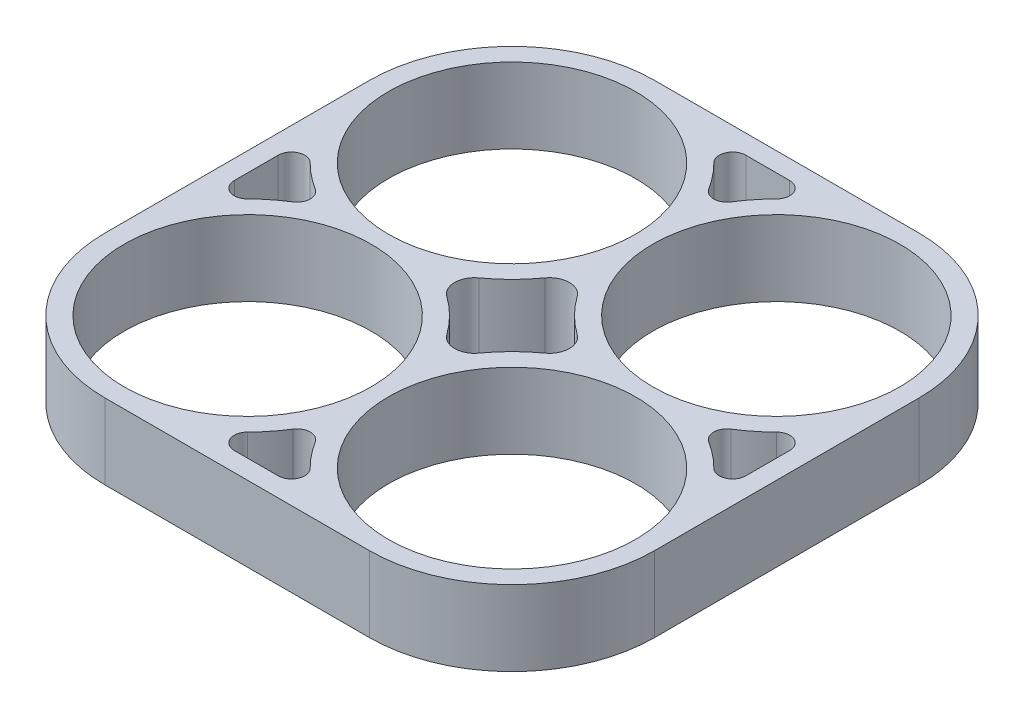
ISO-10303-21;
HEADER;
FILE_DESCRIPTION(('STEP AP214'),'2;1');
FILE_NAME('part.step','',(''),(''),'','','');
FILE_SCHEMA(('AUTOMOTIVE_DESIGN { 1 0 10303 214 1 1 1 1 }'));
ENDSEC;
DATA;
#1=APPLICATION_CONTEXT('core data for automotive mechanical design processes');
#2=APPLICATION_PROTOCOL_DEFINITION('international standard','automotive_design',2000,#1);
#3=PRODUCT_CONTEXT('',#1,'mechanical');
#4=PRODUCT('Part','Part','',(#3));
#5=PRODUCT_RELATED_PRODUCT_CATEGORY('part','',(#4));
#6=PRODUCT_DEFINITION_FORMATION('','',#4);
#7=PRODUCT_DEFINITION_CONTEXT('part definition',#1,'design');
#8=PRODUCT_DEFINITION('design','',#6,#7);
#9=PRODUCT_DEFINITION_SHAPE('','',#8);
#10=(LENGTH_UNIT() NAMED_UNIT(*) SI_UNIT(.MILLI.,.METRE.));
#11=(NAMED_UNIT(*) PLANE_ANGLE_UNIT() SI_UNIT($,.RADIAN.));
#12=(NAMED_UNIT(*) SI_UNIT($,.STERADIAN.) SOLID_ANGLE_UNIT());
#13=UNCERTAINTY_MEASURE_WITH_UNIT(LENGTH_MEASURE(1.E-05),#10,'distance_accuracy_value','');
#14=(GEOMETRIC_REPRESENTATION_CONTEXT(3) GLOBAL_UNCERTAINTY_ASSIGNED_CONTEXT((#13)) GLOBAL_UNIT_ASSIGNED_CONTEXT((#10,
#11,#12)) REPRESENTATION_CONTEXT('',''));
#15=CARTESIAN_POINT('',(0.,0.,0.));
#16=DIRECTION('',(0.,0.,1.));
#17=DIRECTION('',(1.,0.,0.));
#18=AXIS2_PLACEMENT_3D('',#15,#16,#17);
#19=CARTESIAN_POINT('',(-10.,5.7,-10.));
#20=DIRECTION('',(0.,1.,0.));
#21=DIRECTION('',(0.,0.,1.));
#22=AXIS2_PLACEMENT_3D('',#19,#20,#21);
#23=PLANE('',#22);
#24=CARTESIAN_POINT('',(-10.,5.7,10.));
#25=DIRECTION('',(0.,1.,0.));
#26=DIRECTION('',(0.,0.,1.));
#27=AXIS2_PLACEMENT_3D('',#24,#25,#26);
#28=CIRCLE('',#27,9.35);
#29=CARTESIAN_POINT('',(-10.,5.7,19.35));
#30=VERTEX_POINT('',#29);
#31=EDGE_CURVE('E549',#30,#30,#28,.T.);
#32=ORIENTED_EDGE('',*,*,#31,.F.);
#33=EDGE_LOOP('',(#32));
#34=FACE_BOUND('',#33,.T.);
#35=CARTESIAN_POINT('',(-10.,5.7,-10.));
#36=DIRECTION('',(0.,1.,0.));
#37=DIRECTION('',(0.,0.,1.));
#38=AXIS2_PLACEMENT_3D('',#35,#36,#37);
#39=CIRCLE('',#38,9.35);
#40=CARTESIAN_POINT('',(-10.,5.7,-0.650000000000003));
#41=VERTEX_POINT('',#40);
#42=EDGE_CURVE('E561',#41,#41,#39,.T.);
#43=ORIENTED_EDGE('',*,*,#42,.F.);
#44=EDGE_LOOP('',(#43));
#45=FACE_BOUND('',#44,.T.);
#46=CARTESIAN_POINT('',(-10.,5.7,-10.));
#47=DIRECTION('',(0.,1.,0.));
#48=DIRECTION('',(0.,0.,1.));
#49=AXIS2_PLACEMENT_3D('',#46,#47,#48);
#50=CIRCLE('',#49,10.8);
#51=CARTESIAN_POINT('',(-10.,5.7,-20.8));
#52=VERTEX_POINT('',#51);
#53=CARTESIAN_POINT('',(-20.8,5.7,-10.));
#54=VERTEX_POINT('',#53);
#55=EDGE_CURVE('E567',#52,#54,#50,.T.);
#56=ORIENTED_EDGE('',*,*,#55,.T.);
#57=DIRECTION('',(0.,0.,1.));
#58=VECTOR('',#57,1.);
#59=CARTESIAN_POINT('',(-20.8,5.7,-10.));
#60=LINE('',#59,#58);
#61=CARTESIAN_POINT('',(-20.8,5.7,10.));
#62=VERTEX_POINT('',#61);
#63=EDGE_CURVE('E570',#54,#62,#60,.T.);
#64=ORIENTED_EDGE('',*,*,#63,.T.);
#65=CARTESIAN_POINT('',(-10.,5.7,10.));
#66=DIRECTION('',(0.,1.,0.));
#67=DIRECTION('',(0.,0.,1.));
#68=AXIS2_PLACEMENT_3D('',#65,#66,#67);
#69=CIRCLE('',#68,10.8);
#70=CARTESIAN_POINT('',(-10.,5.7,20.8));
#71=VERTEX_POINT('',#70);
#72=EDGE_CURVE('E573',#62,#71,#69,.T.);
#73=ORIENTED_EDGE('',*,*,#72,.T.);
#74=DIRECTION('',(1.,0.,0.));
#75=VECTOR('',#74,1.);
#76=CARTESIAN_POINT('',(-10.,5.7,20.8));
#77=LINE('',#76,#75);
#78=CARTESIAN_POINT('',(10.,5.7,20.8));
#79=VERTEX_POINT('',#78);
#80=EDGE_CURVE('E575',#71,#79,#77,.T.);
#81=ORIENTED_EDGE('',*,*,#80,.T.);
#82=CARTESIAN_POINT('',(10.,5.7,10.));
#83=DIRECTION('',(0.,1.,0.));
#84=DIRECTION('',(0.,0.,1.));
#85=AXIS2_PLACEMENT_3D('',#82,#83,#84);
#86=CIRCLE('',#85,10.8);
#87=CARTESIAN_POINT('',(20.8,5.7,10.));
#88=VERTEX_POINT('',#87);
#89=EDGE_CURVE('E577',#79,#88,#86,.T.);
#90=ORIENTED_EDGE('',*,*,#89,.T.);
#91=DIRECTION('',(0.,0.,-1.));
#92=VECTOR('',#91,1.);
#93=CARTESIAN_POINT('',(20.8,5.7,10.));
#94=LINE('',#93,#92);
#95=CARTESIAN_POINT('',(20.8,5.7,-10.));
#96=VERTEX_POINT('',#95);
#97=EDGE_CURVE('E579',#88,#96,#94,.T.);
#98=ORIENTED_EDGE('',*,*,#97,.T.);
#99=CARTESIAN_POINT('',(10.,5.7,-10.));
#100=DIRECTION('',(0.,1.,0.));
#101=DIRECTION('',(0.,0.,1.));
#102=AXIS2_PLACEMENT_3D('',#99,#100,#101);
#103=CIRCLE('',#102,10.8);
#104=CARTESIAN_POINT('',(10.,5.7,-20.8));
#105=VERTEX_POINT('',#104);
#106=EDGE_CURVE('E581',#96,#105,#103,.T.);
#107=ORIENTED_EDGE('',*,*,#106,.T.);
#108=DIRECTION('',(-1.,0.,0.));
#109=VECTOR('',#108,1.);
#110=CARTESIAN_POINT('',(-10.,5.7,-20.8));
#111=LINE('',#110,#109);
#112=EDGE_CURVE('E583',#105,#52,#111,.T.);
#113=ORIENTED_EDGE('',*,*,#112,.T.);
#114=EDGE_LOOP('',(#56,#64,#73,#81,#90,#98,#107,#113));
#115=FACE_BOUND('',#114,.T.);
#116=CARTESIAN_POINT('',(10.,5.7,-10.));
#117=DIRECTION('',(0.,1.,0.));
#118=DIRECTION('',(0.,0.,1.));
#119=AXIS2_PLACEMENT_3D('',#116,#117,#118);
#120=CIRCLE('',#119,9.35);
#121=CARTESIAN_POINT('',(10.,5.7,-0.650000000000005));
#122=VERTEX_POINT('',#121);
#123=EDGE_CURVE('E555',#122,#122,#120,.T.);
#124=ORIENTED_EDGE('',*,*,#123,.F.);
#125=EDGE_LOOP('',(#124));
#126=FACE_BOUND('',#125,.T.);
#127=CARTESIAN_POINT('',(10.,5.7,10.));
#128=DIRECTION('',(0.,1.,0.));
#129=DIRECTION('',(0.,0.,1.));
#130=AXIS2_PLACEMENT_3D('',#127,#128,#129);
#131=CIRCLE('',#130,9.35);
#132=CARTESIAN_POINT('',(10.,5.7,19.35));
#133=VERTEX_POINT('',#132);
#134=EDGE_CURVE('E543',#133,#133,#131,.T.);
#135=ORIENTED_EDGE('',*,*,#134,.F.);
#136=EDGE_LOOP('',(#135));
#137=FACE_BOUND('',#136,.T.);
#138=CARTESIAN_POINT('',(10.,5.7,-10.));
#139=DIRECTION('',(0.,-1.,0.));
#140=DIRECTION('',(0.,0.,1.));
#141=AXIS2_PLACEMENT_3D('',#138,#139,#140);
#142=CIRCLE('',#141,10.8);
#143=CARTESIAN_POINT('',(0.847457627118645,5.7,-15.7333208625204));
#144=VERTEX_POINT('',#143);
#145=CARTESIAN_POINT('',(2.36887054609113,5.7,-17.6423728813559));
#146=VERTEX_POINT('',#145);
#147=EDGE_CURVE('E500',#144,#146,#142,.T.);
#148=ORIENTED_EDGE('',*,*,#147,.F.);
#149=CARTESIAN_POINT('',(0.,5.7,-16.2641839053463));
#150=DIRECTION('',(0.,1.,0.));
#151=DIRECTION('',(0.,0.,1.));
#152=AXIS2_PLACEMENT_3D('',#149,#150,#151);
#153=CIRCLE('',#152,1.);
#154=CARTESIAN_POINT('',(-0.847457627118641,5.7,-15.7333208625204));
#155=VERTEX_POINT('',#154);
#156=EDGE_CURVE('E498',#155,#144,#153,.T.);
#157=ORIENTED_EDGE('',*,*,#156,.F.);
#158=CARTESIAN_POINT('',(-10.,5.7,-10.));
#159=DIRECTION('',(0.,-1.,0.));
#160=DIRECTION('',(0.,0.,1.));
#161=AXIS2_PLACEMENT_3D('',#158,#159,#160);
#162=CIRCLE('',#161,10.8);
#163=CARTESIAN_POINT('',(-2.36887054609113,5.7,-17.6423728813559));
#164=VERTEX_POINT('',#163);
#165=EDGE_CURVE('E510',#164,#155,#162,.T.);
#166=ORIENTED_EDGE('',*,*,#165,.F.);
#167=CARTESIAN_POINT('',(-1.66228448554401,5.7,-18.35));
#168=DIRECTION('',(0.,1.,0.));
#169=DIRECTION('',(0.,0.,-1.));
#170=AXIS2_PLACEMENT_3D('',#167,#168,#169);
#171=CIRCLE('',#170,1.);
#172=CARTESIAN_POINT('',(-1.66228448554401,5.7,-19.35));
#173=VERTEX_POINT('',#172);
#174=EDGE_CURVE('E507',#173,#164,#171,.T.);
#175=ORIENTED_EDGE('',*,*,#174,.F.);
#176=DIRECTION('',(-1.,0.,0.));
#177=VECTOR('',#176,1.);
#178=CARTESIAN_POINT('',(-1.66228448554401,5.7,-19.35));
#179=LINE('',#178,#177);
#180=CARTESIAN_POINT('',(1.66228448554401,5.7,-19.35));
#181=VERTEX_POINT('',#180);
#182=EDGE_CURVE('E505',#181,#173,#179,.T.);
#183=ORIENTED_EDGE('',*,*,#182,.F.);
#184=CARTESIAN_POINT('',(1.66228448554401,5.7,-18.35));
#185=DIRECTION('',(0.,1.,0.));
#186=DIRECTION('',(0.,0.,1.));
#187=AXIS2_PLACEMENT_3D('',#184,#185,#186);
#188=CIRCLE('',#187,1.);
#189=EDGE_CURVE('E503',#146,#181,#188,.T.);
#190=ORIENTED_EDGE('',*,*,#189,.F.);
#191=EDGE_LOOP('',(#148,#157,#166,#175,#183,#190));
#192=FACE_BOUND('',#191,.T.);
#193=CARTESIAN_POINT('',(10.,5.7,10.));
#194=DIRECTION('',(0.,-1.,0.));
#195=DIRECTION('',(0.,0.,1.));
#196=AXIS2_PLACEMENT_3D('',#193,#194,#195);
#197=CIRCLE('',#196,10.8);
#198=CARTESIAN_POINT('',(15.7333208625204,5.7,0.847457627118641));
#199=VERTEX_POINT('',#198);
#200=CARTESIAN_POINT('',(17.6423728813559,5.7,2.36887054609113));
#201=VERTEX_POINT('',#200);
#202=EDGE_CURVE('E455',#199,#201,#197,.T.);
#203=ORIENTED_EDGE('',*,*,#202,.F.);
#204=CARTESIAN_POINT('',(16.2641839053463,5.7,0.));
#205=DIRECTION('',(0.,1.,0.));
#206=DIRECTION('',(0.,0.,-1.));
#207=AXIS2_PLACEMENT_3D('',#204,#205,#206);
#208=CIRCLE('',#207,1.);
#209=CARTESIAN_POINT('',(15.7333208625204,5.7,-0.847457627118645));
#210=VERTEX_POINT('',#209);
#211=EDGE_CURVE('E453',#210,#199,#208,.T.);
#212=ORIENTED_EDGE('',*,*,#211,.F.);
#213=CARTESIAN_POINT('',(10.,5.7,-10.));
#214=DIRECTION('',(0.,-1.,0.));
#215=DIRECTION('',(0.,0.,1.));
#216=AXIS2_PLACEMENT_3D('',#213,#214,#215);
#217=CIRCLE('',#216,10.8);
#218=CARTESIAN_POINT('',(17.6423728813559,5.7,-2.36887054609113));
#219=VERTEX_POINT('',#218);
#220=EDGE_CURVE('E465',#219,#210,#217,.T.);
#221=ORIENTED_EDGE('',*,*,#220,.F.);
#222=CARTESIAN_POINT('',(18.35,5.7,-1.66228448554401));
#223=DIRECTION('',(0.,1.,0.));
#224=DIRECTION('',(0.,0.,1.));
#225=AXIS2_PLACEMENT_3D('',#222,#223,#224);
#226=CIRCLE('',#225,1.);
#227=CARTESIAN_POINT('',(19.35,5.7,-1.66228448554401));
#228=VERTEX_POINT('',#227);
#229=EDGE_CURVE('E462',#228,#219,#226,.T.);
#230=ORIENTED_EDGE('',*,*,#229,.F.);
#231=DIRECTION('',(0.,0.,-1.));
#232=VECTOR('',#231,1.);
#233=CARTESIAN_POINT('',(19.35,5.7,-1.66228448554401));
#234=LINE('',#233,#232);
#235=CARTESIAN_POINT('',(19.35,5.7,1.66228448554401));
#236=VERTEX_POINT('',#235);
#237=EDGE_CURVE('E460',#236,#228,#234,.T.);
#238=ORIENTED_EDGE('',*,*,#237,.F.);
#239=CARTESIAN_POINT('',(18.35,5.7,1.66228448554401));
#240=DIRECTION('',(0.,1.,0.));
#241=DIRECTION('',(0.,0.,1.));
#242=AXIS2_PLACEMENT_3D('',#239,#240,#241);
#243=CIRCLE('',#242,1.);
#244=EDGE_CURVE('E458',#201,#236,#243,.T.);
#245=ORIENTED_EDGE('',*,*,#244,.F.);
#246=EDGE_LOOP('',(#203,#212,#221,#230,#238,#245));
#247=FACE_BOUND('',#246,.T.);
#248=DIRECTION('',(1.,0.,0.));
#249=VECTOR('',#248,1.);
#250=CARTESIAN_POINT('',(-1.66228448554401,5.7,19.35));
#251=LINE('',#250,#249);
#252=CARTESIAN_POINT('',(-1.66228448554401,5.7,19.35));
#253=VERTEX_POINT('',#252);
#254=CARTESIAN_POINT('',(1.66228448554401,5.7,19.35));
#255=VERTEX_POINT('',#254);
#256=EDGE_CURVE('E410',#253,#255,#251,.T.);
#257=ORIENTED_EDGE('',*,*,#256,.F.);
#258=CARTESIAN_POINT('',(-1.66228448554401,5.7,18.35));
#259=DIRECTION('',(0.,1.,0.));
#260=DIRECTION('',(0.,0.,-1.));
#261=AXIS2_PLACEMENT_3D('',#258,#259,#260);
#262=CIRCLE('',#261,0.999999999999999);
#263=CARTESIAN_POINT('',(-2.36887054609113,5.7,17.6423728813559));
#264=VERTEX_POINT('',#263);
#265=EDGE_CURVE('E408',#264,#253,#262,.T.);
#266=ORIENTED_EDGE('',*,*,#265,.F.);
#267=CARTESIAN_POINT('',(-10.,5.7,10.));
#268=DIRECTION('',(0.,-1.,0.));
#269=DIRECTION('',(0.,0.,1.));
#270=AXIS2_PLACEMENT_3D('',#267,#268,#269);
#271=CIRCLE('',#270,10.8);
#272=CARTESIAN_POINT('',(-0.847457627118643,5.7,15.7333208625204));
#273=VERTEX_POINT('',#272);
#274=EDGE_CURVE('E420',#273,#264,#271,.T.);
#275=ORIENTED_EDGE('',*,*,#274,.F.);
#276=CARTESIAN_POINT('',(0.,5.7,16.2641839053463));
#277=DIRECTION('',(0.,1.,0.));
#278=DIRECTION('',(0.,0.,1.));
#279=AXIS2_PLACEMENT_3D('',#276,#277,#278);
#280=CIRCLE('',#279,1.);
#281=CARTESIAN_POINT('',(0.847457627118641,5.7,15.7333208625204));
#282=VERTEX_POINT('',#281);
#283=EDGE_CURVE('E417',#282,#273,#280,.T.);
#284=ORIENTED_EDGE('',*,*,#283,.F.);
#285=CARTESIAN_POINT('',(10.,5.7,10.));
#286=DIRECTION('',(0.,-1.,0.));
#287=DIRECTION('',(0.,0.,1.));
#288=AXIS2_PLACEMENT_3D('',#285,#286,#287);
#289=CIRCLE('',#288,10.8);
#290=CARTESIAN_POINT('',(2.36887054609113,5.7,17.6423728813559));
#291=VERTEX_POINT('',#290);
#292=EDGE_CURVE('E415',#291,#282,#289,.T.);
#293=ORIENTED_EDGE('',*,*,#292,.F.);
#294=CARTESIAN_POINT('',(1.66228448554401,5.7,18.35));
#295=DIRECTION('',(0.,1.,0.));
#296=DIRECTION('',(0.,0.,1.));
#297=AXIS2_PLACEMENT_3D('',#294,#295,#296);
#298=CIRCLE('',#297,0.999999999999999);
#299=EDGE_CURVE('E413',#255,#291,#298,.T.);
#300=ORIENTED_EDGE('',*,*,#299,.F.);
#301=EDGE_LOOP('',(#257,#266,#275,#284,#293,#300));
#302=FACE_BOUND('',#301,.T.);
#303=CARTESIAN_POINT('',(-10.,5.7,10.));
#304=DIRECTION('',(0.,-1.,0.));
#305=DIRECTION('',(0.,0.,1.));
#306=AXIS2_PLACEMENT_3D('',#303,#304,#305);
#307=CIRCLE('',#306,10.8);
#308=CARTESIAN_POINT('',(-17.6423728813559,5.7,2.36887054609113));
#309=VERTEX_POINT('',#308);
#310=CARTESIAN_POINT('',(-15.7333208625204,5.7,0.847457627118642));
#311=VERTEX_POINT('',#310);
#312=EDGE_CURVE('E365',#309,#311,#307,.T.);
#313=ORIENTED_EDGE('',*,*,#312,.F.);
#314=CARTESIAN_POINT('',(-18.35,5.7,1.66228448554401));
#315=DIRECTION('',(0.,1.,0.));
#316=DIRECTION('',(0.,0.,1.));
#317=AXIS2_PLACEMENT_3D('',#314,#315,#316);
#318=CIRCLE('',#317,0.999999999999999);
#319=CARTESIAN_POINT('',(-19.35,5.7,1.66228448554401));
#320=VERTEX_POINT('',#319);
#321=EDGE_CURVE('E363',#320,#309,#318,.T.);
#322=ORIENTED_EDGE('',*,*,#321,.F.);
#323=DIRECTION('',(0.,0.,1.));
#324=VECTOR('',#323,1.);
#325=CARTESIAN_POINT('',(-19.35,5.7,-1.66228448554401));
#326=LINE('',#325,#324);
#327=CARTESIAN_POINT('',(-19.35,5.7,-1.66228448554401));
#328=VERTEX_POINT('',#327);
#329=EDGE_CURVE('E375',#328,#320,#326,.T.);
#330=ORIENTED_EDGE('',*,*,#329,.F.);
#331=CARTESIAN_POINT('',(-18.35,5.7,-1.66228448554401));
#332=DIRECTION('',(0.,1.,0.));
#333=DIRECTION('',(0.,0.,1.));
#334=AXIS2_PLACEMENT_3D('',#331,#332,#333);
#335=CIRCLE('',#334,0.999999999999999);
#336=CARTESIAN_POINT('',(-17.6423728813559,5.7,-2.36887054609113));
#337=VERTEX_POINT('',#336);
#338=EDGE_CURVE('E372',#337,#328,#335,.T.);
#339=ORIENTED_EDGE('',*,*,#338,.F.);
#340=CARTESIAN_POINT('',(-10.,5.7,-10.));
#341=DIRECTION('',(0.,-1.,0.));
#342=DIRECTION('',(0.,0.,1.));
#343=AXIS2_PLACEMENT_3D('',#340,#341,#342);
#344=CIRCLE('',#343,10.8);
#345=CARTESIAN_POINT('',(-15.7333208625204,5.7,-0.847457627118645));
#346=VERTEX_POINT('',#345);
#347=EDGE_CURVE('E370',#346,#337,#344,.T.);
#348=ORIENTED_EDGE('',*,*,#347,.F.);
#349=CARTESIAN_POINT('',(-16.2641839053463,5.7,0.));
#350=DIRECTION('',(0.,1.,0.));
#351=DIRECTION('',(0.,0.,1.));
#352=AXIS2_PLACEMENT_3D('',#349,#350,#351);
#353=CIRCLE('',#352,1.);
#354=EDGE_CURVE('E368',#311,#346,#353,.T.);
#355=ORIENTED_EDGE('',*,*,#354,.F.);
#356=EDGE_LOOP('',(#313,#322,#330,#339,#348,#355));
#357=FACE_BOUND('',#356,.T.);
#358=CARTESIAN_POINT('',(-10.,5.7,10.));
#359=DIRECTION('',(0.,-1.,0.));
#360=DIRECTION('',(0.,0.,1.));
#361=AXIS2_PLACEMENT_3D('',#358,#359,#360);
#362=CIRCLE('',#361,10.8);
#363=CARTESIAN_POINT('',(-3.71167479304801,5.7,1.21951219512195));
#364=VERTEX_POINT('',#363);
#365=CARTESIAN_POINT('',(-1.21951219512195,5.7,3.71167479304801));
#366=VERTEX_POINT('',#365);
#367=EDGE_CURVE('E306',#364,#366,#362,.T.);
#368=ORIENTED_EDGE('',*,*,#367,.F.);
#369=CARTESIAN_POINT('',(-2.83829629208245,5.7,0.));
#370=DIRECTION('',(0.,1.,0.));
#371=DIRECTION('',(0.,0.,-1.));
#372=AXIS2_PLACEMENT_3D('',#369,#370,#371);
#373=CIRCLE('',#372,1.5);
#374=CARTESIAN_POINT('',(-3.71167479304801,5.7,-1.21951219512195));
#375=VERTEX_POINT('',#374);
#376=EDGE_CURVE('E298',#375,#364,#373,.T.);
#377=ORIENTED_EDGE('',*,*,#376,.F.);
#378=CARTESIAN_POINT('',(-10.,5.7,-10.));
#379=DIRECTION('',(0.,-1.,0.));
#380=DIRECTION('',(0.,0.,1.));
#381=AXIS2_PLACEMENT_3D('',#378,#379,#380);
#382=CIRCLE('',#381,10.8);
#383=CARTESIAN_POINT('',(-1.21951219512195,5.7,-3.71167479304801));
#384=VERTEX_POINT('',#383);
#385=EDGE_CURVE('E331',#384,#375,#382,.T.);
#386=ORIENTED_EDGE('',*,*,#385,.F.);
#387=CARTESIAN_POINT('',(0.,5.7,-2.83829629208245));
#388=DIRECTION('',(0.,1.,0.));
#389=DIRECTION('',(0.,0.,1.));
#390=AXIS2_PLACEMENT_3D('',#387,#388,#389);
#391=CIRCLE('',#390,1.5);
#392=CARTESIAN_POINT('',(1.21951219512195,5.7,-3.71167479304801));
#393=VERTEX_POINT('',#392);
#394=EDGE_CURVE('E329',#393,#384,#391,.T.);
#395=ORIENTED_EDGE('',*,*,#394,.F.);
#396=CARTESIAN_POINT('',(10.,5.7,-10.));
#397=DIRECTION('',(0.,-1.,0.));
#398=DIRECTION('',(0.,0.,1.));
#399=AXIS2_PLACEMENT_3D('',#396,#397,#398);
#400=CIRCLE('',#399,10.8);
#401=CARTESIAN_POINT('',(3.71167479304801,5.7,-1.21951219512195));
#402=VERTEX_POINT('',#401);
#403=EDGE_CURVE('E327',#402,#393,#400,.T.);
#404=ORIENTED_EDGE('',*,*,#403,.F.);
#405=CARTESIAN_POINT('',(2.83829629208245,5.7,0.));
#406=DIRECTION('',(0.,1.,0.));
#407=DIRECTION('',(0.,0.,1.));
#408=AXIS2_PLACEMENT_3D('',#405,#406,#407);
#409=CIRCLE('',#408,1.5);
#410=CARTESIAN_POINT('',(3.71167479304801,5.7,1.21951219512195));
#411=VERTEX_POINT('',#410);
#412=EDGE_CURVE('E325',#411,#402,#409,.T.);
#413=ORIENTED_EDGE('',*,*,#412,.F.);
#414=CARTESIAN_POINT('',(10.,5.7,10.));
#415=DIRECTION('',(0.,-1.,0.));
#416=DIRECTION('',(0.,0.,1.));
#417=AXIS2_PLACEMENT_3D('',#414,#415,#416);
#418=CIRCLE('',#417,10.8);
#419=CARTESIAN_POINT('',(1.21951219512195,5.7,3.71167479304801));
#420=VERTEX_POINT('',#419);
#421=EDGE_CURVE('E321',#420,#411,#418,.T.);
#422=ORIENTED_EDGE('',*,*,#421,.F.);
#423=CARTESIAN_POINT('',(0.,5.7,2.83829629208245));
#424=DIRECTION('',(0.,1.,0.));
#425=DIRECTION('',(0.,0.,1.));
#426=AXIS2_PLACEMENT_3D('',#423,#424,#425);
#427=CIRCLE('',#426,1.5);
#428=EDGE_CURVE('E319',#366,#420,#427,.T.);
#429=ORIENTED_EDGE('',*,*,#428,.F.);
#430=EDGE_LOOP('',(#368,#377,#386,#395,#404,#413,#422,#429));
#431=FACE_BOUND('',#430,.T.);
#432=ADVANCED_FACE('F41',(#34,#45,#115,#126,#137,#192,#247,#302,#357,#431),#23,.T.);
#433=CARTESIAN_POINT('',(-10.,0.,-10.));
#434=DIRECTION('',(0.,1.,0.));
#435=DIRECTION('',(0.,0.,1.));
#436=AXIS2_PLACEMENT_3D('',#433,#434,#435);
#437=PLANE('',#436);
#438=CARTESIAN_POINT('',(-18.35,0.,1.66228448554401));
#439=DIRECTION('',(0.,1.,0.));
#440=DIRECTION('',(0.,0.,1.));
#441=AXIS2_PLACEMENT_3D('',#438,#439,#440);
#442=CIRCLE('',#441,0.999999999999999);
#443=CARTESIAN_POINT('',(-19.35,0.,1.66228448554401));
#444=VERTEX_POINT('',#443);
#445=CARTESIAN_POINT('',(-17.6423728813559,0.,2.36887054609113));
#446=VERTEX_POINT('',#445);
#447=EDGE_CURVE('E314',#444,#446,#442,.T.);
#448=ORIENTED_EDGE('',*,*,#447,.T.);
#449=CARTESIAN_POINT('',(-10.,0.,10.));
#450=DIRECTION('',(0.,-1.,0.));
#451=DIRECTION('',(0.,0.,1.));
#452=AXIS2_PLACEMENT_3D('',#449,#450,#451);
#453=CIRCLE('',#452,10.8);
#454=CARTESIAN_POINT('',(-15.7333208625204,0.,0.847457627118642));
#455=VERTEX_POINT('',#454);
#456=EDGE_CURVE('E380',#446,#455,#453,.T.);
#457=ORIENTED_EDGE('',*,*,#456,.T.);
#458=CARTESIAN_POINT('',(-16.2641839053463,0.,0.));
#459=DIRECTION('',(0.,1.,0.));
#460=DIRECTION('',(0.,0.,1.));
#461=AXIS2_PLACEMENT_3D('',#458,#459,#460);
#462=CIRCLE('',#461,1.);
#463=CARTESIAN_POINT('',(-15.7333208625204,0.,-0.847457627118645));
#464=VERTEX_POINT('',#463);
#465=EDGE_CURVE('E383',#455,#464,#462,.T.);
#466=ORIENTED_EDGE('',*,*,#465,.T.);
#467=CARTESIAN_POINT('',(-10.,0.,-10.));
#468=DIRECTION('',(0.,-1.,0.));
#469=DIRECTION('',(0.,0.,1.));
#470=AXIS2_PLACEMENT_3D('',#467,#468,#469);
#471=CIRCLE('',#470,10.8);
#472=CARTESIAN_POINT('',(-17.6423728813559,0.,-2.36887054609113));
#473=VERTEX_POINT('',#472);
#474=EDGE_CURVE('E386',#464,#473,#471,.T.);
#475=ORIENTED_EDGE('',*,*,#474,.T.);
#476=CARTESIAN_POINT('',(-18.35,0.,-1.66228448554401));
#477=DIRECTION('',(0.,1.,0.));
#478=DIRECTION('',(0.,0.,1.));
#479=AXIS2_PLACEMENT_3D('',#476,#477,#478);
#480=CIRCLE('',#479,0.999999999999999);
#481=CARTESIAN_POINT('',(-19.35,0.,-1.66228448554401));
#482=VERTEX_POINT('',#481);
#483=EDGE_CURVE('E389',#473,#482,#480,.T.);
#484=ORIENTED_EDGE('',*,*,#483,.T.);
#485=DIRECTION('',(0.,0.,1.));
#486=VECTOR('',#485,1.);
#487=CARTESIAN_POINT('',(-19.35,0.,-1.66228448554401));
#488=LINE('',#487,#486);
#489=EDGE_CURVE('E366',#482,#444,#488,.T.);
#490=ORIENTED_EDGE('',*,*,#489,.T.);
#491=EDGE_LOOP('',(#448,#457,#466,#475,#484,#490));
#492=FACE_BOUND('',#491,.T.);
#493=CARTESIAN_POINT('',(16.2641839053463,0.,0.));
#494=DIRECTION('',(0.,1.,0.));
#495=DIRECTION('',(0.,0.,-1.));
#496=AXIS2_PLACEMENT_3D('',#493,#494,#495);
#497=CIRCLE('',#496,1.);
#498=CARTESIAN_POINT('',(15.7333208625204,0.,-0.847457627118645));
#499=VERTEX_POINT('',#498);
#500=CARTESIAN_POINT('',(15.7333208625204,0.,0.847457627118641));
#501=VERTEX_POINT('',#500);
#502=EDGE_CURVE('E452',#499,#501,#497,.T.);
#503=ORIENTED_EDGE('',*,*,#502,.T.);
#504=CARTESIAN_POINT('',(10.,0.,10.));
#505=DIRECTION('',(0.,-1.,0.));
#506=DIRECTION('',(0.,0.,1.));
#507=AXIS2_PLACEMENT_3D('',#504,#505,#506);
#508=CIRCLE('',#507,10.8);
#509=CARTESIAN_POINT('',(17.6423728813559,0.,2.36887054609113));
#510=VERTEX_POINT('',#509);
#511=EDGE_CURVE('E470',#501,#510,#508,.T.);
#512=ORIENTED_EDGE('',*,*,#511,.T.);
#513=CARTESIAN_POINT('',(18.35,0.,1.66228448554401));
#514=DIRECTION('',(0.,1.,0.));
#515=DIRECTION('',(0.,0.,1.));
#516=AXIS2_PLACEMENT_3D('',#513,#514,#515);
#517=CIRCLE('',#516,1.);
#518=CARTESIAN_POINT('',(19.35,0.,1.66228448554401));
#519=VERTEX_POINT('',#518);
#520=EDGE_CURVE('E473',#510,#519,#517,.T.);
#521=ORIENTED_EDGE('',*,*,#520,.T.);
#522=DIRECTION('',(0.,0.,-1.));
#523=VECTOR('',#522,1.);
#524=CARTESIAN_POINT('',(19.35,0.,-1.66228448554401));
#525=LINE('',#524,#523);
#526=CARTESIAN_POINT('',(19.35,0.,-1.66228448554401));
#527=VERTEX_POINT('',#526);
#528=EDGE_CURVE('E476',#519,#527,#525,.T.);
#529=ORIENTED_EDGE('',*,*,#528,.T.);
#530=CARTESIAN_POINT('',(18.35,0.,-1.66228448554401));
#531=DIRECTION('',(0.,1.,0.));
#532=DIRECTION('',(0.,0.,1.));
#533=AXIS2_PLACEMENT_3D('',#530,#531,#532);
#534=CIRCLE('',#533,1.);
#535=CARTESIAN_POINT('',(17.6423728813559,0.,-2.36887054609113));
#536=VERTEX_POINT('',#535);
#537=EDGE_CURVE('E479',#527,#536,#534,.T.);
#538=ORIENTED_EDGE('',*,*,#537,.T.);
#539=CARTESIAN_POINT('',(10.,0.,-10.));
#540=DIRECTION('',(0.,-1.,0.));
#541=DIRECTION('',(0.,0.,1.));
#542=AXIS2_PLACEMENT_3D('',#539,#540,#541);
#543=CIRCLE('',#542,10.8);
#544=EDGE_CURVE('E456',#536,#499,#543,.T.);
#545=ORIENTED_EDGE('',*,*,#544,.T.);
#546=EDGE_LOOP('',(#503,#512,#521,#529,#538,#545));
#547=FACE_BOUND('',#546,.T.);
#548=CARTESIAN_POINT('',(10.,0.,10.));
#549=DIRECTION('',(0.,1.,0.));
#550=DIRECTION('',(0.,0.,1.));
#551=AXIS2_PLACEMENT_3D('',#548,#549,#550);
#552=CIRCLE('',#551,9.35);
#553=CARTESIAN_POINT('',(10.,0.,19.35));
#554=VERTEX_POINT('',#553);
#555=EDGE_CURVE('E542',#554,#554,#552,.T.);
#556=ORIENTED_EDGE('',*,*,#555,.T.);
#557=EDGE_LOOP('',(#556));
#558=FACE_BOUND('',#557,.T.);
#559=CARTESIAN_POINT('',(-10.,0.,10.));
#560=DIRECTION('',(0.,1.,0.));
#561=DIRECTION('',(0.,0.,1.));
#562=AXIS2_PLACEMENT_3D('',#559,#560,#561);
#563=CIRCLE('',#562,9.35);
#564=CARTESIAN_POINT('',(-10.,0.,19.35));
#565=VERTEX_POINT('',#564);
#566=EDGE_CURVE('E546',#565,#565,#563,.T.);
#567=ORIENTED_EDGE('',*,*,#566,.T.);
#568=EDGE_LOOP('',(#567));
#569=FACE_BOUND('',#568,.T.);
#570=CARTESIAN_POINT('',(10.,0.,-10.));
#571=DIRECTION('',(0.,1.,0.));
#572=DIRECTION('',(0.,0.,1.));
#573=AXIS2_PLACEMENT_3D('',#570,#571,#572);
#574=CIRCLE('',#573,9.35);
#575=CARTESIAN_POINT('',(10.,0.,-0.650000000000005));
#576=VERTEX_POINT('',#575);
#577=EDGE_CURVE('E552',#576,#576,#574,.T.);
#578=ORIENTED_EDGE('',*,*,#577,.T.);
#579=EDGE_LOOP('',(#578));
#580=FACE_BOUND('',#579,.T.);
#581=CARTESIAN_POINT('',(-10.,0.,-10.));
#582=DIRECTION('',(0.,1.,0.));
#583=DIRECTION('',(0.,0.,1.));
#584=AXIS2_PLACEMENT_3D('',#581,#582,#583);
#585=CIRCLE('',#584,9.35);
#586=CARTESIAN_POINT('',(-10.,0.,-0.650000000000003));
#587=VERTEX_POINT('',#586);
#588=EDGE_CURVE('E558',#587,#587,#585,.T.);
#589=ORIENTED_EDGE('',*,*,#588,.T.);
#590=EDGE_LOOP('',(#589));
#591=FACE_BOUND('',#590,.T.);
#592=CARTESIAN_POINT('',(-10.,0.,-10.));
#593=DIRECTION('',(0.,1.,0.));
#594=DIRECTION('',(0.,0.,1.));
#595=AXIS2_PLACEMENT_3D('',#592,#593,#594);
#596=CIRCLE('',#595,10.8);
#597=CARTESIAN_POINT('',(-10.,0.,-20.8));
#598=VERTEX_POINT('',#597);
#599=CARTESIAN_POINT('',(-20.8,0.,-10.));
#600=VERTEX_POINT('',#599);
#601=EDGE_CURVE('E564',#598,#600,#596,.T.);
#602=ORIENTED_EDGE('',*,*,#601,.F.);
#603=DIRECTION('',(-1.,0.,0.));
#604=VECTOR('',#603,1.);
#605=CARTESIAN_POINT('',(-10.,0.,-20.8));
#606=LINE('',#605,#604);
#607=CARTESIAN_POINT('',(10.,0.,-20.8));
#608=VERTEX_POINT('',#607);
#609=EDGE_CURVE('E571',#608,#598,#606,.T.);
#610=ORIENTED_EDGE('',*,*,#609,.F.);
#611=CARTESIAN_POINT('',(10.,0.,-10.));
#612=DIRECTION('',(0.,1.,0.));
#613=DIRECTION('',(0.,0.,1.));
#614=AXIS2_PLACEMENT_3D('',#611,#612,#613);
#615=CIRCLE('',#614,10.8);
#616=CARTESIAN_POINT('',(20.8,0.,-10.));
#617=VERTEX_POINT('',#616);
#618=EDGE_CURVE('E598',#617,#608,#615,.T.);
#619=ORIENTED_EDGE('',*,*,#618,.F.);
#620=DIRECTION('',(0.,0.,-1.));
#621=VECTOR('',#620,1.);
#622=CARTESIAN_POINT('',(20.8,0.,10.));
#623=LINE('',#622,#621);
#624=CARTESIAN_POINT('',(20.8,0.,10.));
#625=VERTEX_POINT('',#624);
#626=EDGE_CURVE('E596',#625,#617,#623,.T.);
#627=ORIENTED_EDGE('',*,*,#626,.F.);
#628=CARTESIAN_POINT('',(10.,0.,10.));
#629=DIRECTION('',(0.,1.,0.));
#630=DIRECTION('',(0.,0.,1.));
#631=AXIS2_PLACEMENT_3D('',#628,#629,#630);
#632=CIRCLE('',#631,10.8);
#633=CARTESIAN_POINT('',(10.,0.,20.8));
#634=VERTEX_POINT('',#633);
#635=EDGE_CURVE('E594',#634,#625,#632,.T.);
#636=ORIENTED_EDGE('',*,*,#635,.F.);
#637=DIRECTION('',(1.,0.,0.));
#638=VECTOR('',#637,1.);
#639=CARTESIAN_POINT('',(-10.,0.,20.8));
#640=LINE('',#639,#638);
#641=CARTESIAN_POINT('',(-10.,0.,20.8));
#642=VERTEX_POINT('',#641);
#643=EDGE_CURVE('E592',#642,#634,#640,.T.);
#644=ORIENTED_EDGE('',*,*,#643,.F.);
#645=CARTESIAN_POINT('',(-10.,0.,10.));
#646=DIRECTION('',(0.,1.,0.));
#647=DIRECTION('',(0.,0.,1.));
#648=AXIS2_PLACEMENT_3D('',#645,#646,#647);
#649=CIRCLE('',#648,10.8);
#650=CARTESIAN_POINT('',(-20.8,0.,10.));
#651=VERTEX_POINT('',#650);
#652=EDGE_CURVE('E590',#651,#642,#649,.T.);
#653=ORIENTED_EDGE('',*,*,#652,.F.);
#654=DIRECTION('',(0.,0.,1.));
#655=VECTOR('',#654,1.);
#656=CARTESIAN_POINT('',(-20.8,0.,-10.));
#657=LINE('',#656,#655);
#658=EDGE_CURVE('E588',#600,#651,#657,.T.);
#659=ORIENTED_EDGE('',*,*,#658,.F.);
#660=EDGE_LOOP('',(#602,#610,#619,#627,#636,#644,#653,#659));
#661=FACE_BOUND('',#660,.T.);
#662=CARTESIAN_POINT('',(0.,0.,-16.2641839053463));
#663=DIRECTION('',(0.,1.,0.));
#664=DIRECTION('',(0.,0.,1.));
#665=AXIS2_PLACEMENT_3D('',#662,#663,#664);
#666=CIRCLE('',#665,1.);
#667=CARTESIAN_POINT('',(-0.847457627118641,0.,-15.7333208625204));
#668=VERTEX_POINT('',#667);
#669=CARTESIAN_POINT('',(0.847457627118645,0.,-15.7333208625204));
#670=VERTEX_POINT('',#669);
#671=EDGE_CURVE('E497',#668,#670,#666,.T.);
#672=ORIENTED_EDGE('',*,*,#671,.T.);
#673=CARTESIAN_POINT('',(10.,0.,-10.));
#674=DIRECTION('',(0.,-1.,0.));
#675=DIRECTION('',(0.,0.,1.));
#676=AXIS2_PLACEMENT_3D('',#673,#674,#675);
#677=CIRCLE('',#676,10.8);
#678=CARTESIAN_POINT('',(2.36887054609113,0.,-17.6423728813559));
#679=VERTEX_POINT('',#678);
#680=EDGE_CURVE('E515',#670,#679,#677,.T.);
#681=ORIENTED_EDGE('',*,*,#680,.T.);
#682=CARTESIAN_POINT('',(1.66228448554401,0.,-18.35));
#683=DIRECTION('',(0.,1.,0.));
#684=DIRECTION('',(0.,0.,1.));
#685=AXIS2_PLACEMENT_3D('',#682,#683,#684);
#686=CIRCLE('',#685,1.);
#687=CARTESIAN_POINT('',(1.66228448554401,0.,-19.35));
#688=VERTEX_POINT('',#687);
#689=EDGE_CURVE('E518',#679,#688,#686,.T.);
#690=ORIENTED_EDGE('',*,*,#689,.T.);
#691=DIRECTION('',(-1.,0.,0.));
#692=VECTOR('',#691,1.);
#693=CARTESIAN_POINT('',(-1.66228448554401,0.,-19.35));
#694=LINE('',#693,#692);
#695=CARTESIAN_POINT('',(-1.66228448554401,0.,-19.35));
#696=VERTEX_POINT('',#695);
#697=EDGE_CURVE('E521',#688,#696,#694,.T.);
#698=ORIENTED_EDGE('',*,*,#697,.T.);
#699=CARTESIAN_POINT('',(-1.66228448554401,0.,-18.35));
#700=DIRECTION('',(0.,1.,0.));
#701=DIRECTION('',(0.,0.,-1.));
#702=AXIS2_PLACEMENT_3D('',#699,#700,#701);
#703=CIRCLE('',#702,1.);
#704=CARTESIAN_POINT('',(-2.36887054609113,0.,-17.6423728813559));
#705=VERTEX_POINT('',#704);
#706=EDGE_CURVE('E524',#696,#705,#703,.T.);
#707=ORIENTED_EDGE('',*,*,#706,.T.);
#708=CARTESIAN_POINT('',(-10.,0.,-10.));
#709=DIRECTION('',(0.,-1.,0.));
#710=DIRECTION('',(0.,0.,1.));
#711=AXIS2_PLACEMENT_3D('',#708,#709,#710);
#712=CIRCLE('',#711,10.8);
#713=EDGE_CURVE('E501',#705,#668,#712,.T.);
#714=ORIENTED_EDGE('',*,*,#713,.T.);
#715=EDGE_LOOP('',(#672,#681,#690,#698,#707,#714));
#716=FACE_BOUND('',#715,.T.);
#717=CARTESIAN_POINT('',(-1.66228448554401,0.,18.35));
#718=DIRECTION('',(0.,1.,0.));
#719=DIRECTION('',(0.,0.,-1.));
#720=AXIS2_PLACEMENT_3D('',#717,#718,#719);
#721=CIRCLE('',#720,0.999999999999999);
#722=CARTESIAN_POINT('',(-2.36887054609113,0.,17.6423728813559));
#723=VERTEX_POINT('',#722);
#724=CARTESIAN_POINT('',(-1.66228448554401,0.,19.35));
#725=VERTEX_POINT('',#724);
#726=EDGE_CURVE('E407',#723,#725,#721,.T.);
#727=ORIENTED_EDGE('',*,*,#726,.T.);
#728=DIRECTION('',(1.,0.,0.));
#729=VECTOR('',#728,1.);
#730=CARTESIAN_POINT('',(-1.66228448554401,0.,19.35));
#731=LINE('',#730,#729);
#732=CARTESIAN_POINT('',(1.66228448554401,0.,19.35));
#733=VERTEX_POINT('',#732);
#734=EDGE_CURVE('E425',#725,#733,#731,.T.);
#735=ORIENTED_EDGE('',*,*,#734,.T.);
#736=CARTESIAN_POINT('',(1.66228448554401,0.,18.35));
#737=DIRECTION('',(0.,1.,0.));
#738=DIRECTION('',(0.,0.,1.));
#739=AXIS2_PLACEMENT_3D('',#736,#737,#738);
#740=CIRCLE('',#739,0.999999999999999);
#741=CARTESIAN_POINT('',(2.36887054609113,0.,17.6423728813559));
#742=VERTEX_POINT('',#741);
#743=EDGE_CURVE('E428',#733,#742,#740,.T.);
#744=ORIENTED_EDGE('',*,*,#743,.T.);
#745=CARTESIAN_POINT('',(10.,0.,10.));
#746=DIRECTION('',(0.,-1.,0.));
#747=DIRECTION('',(0.,0.,1.));
#748=AXIS2_PLACEMENT_3D('',#745,#746,#747);
#749=CIRCLE('',#748,10.8);
#750=CARTESIAN_POINT('',(0.847457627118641,0.,15.7333208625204));
#751=VERTEX_POINT('',#750);
#752=EDGE_CURVE('E431',#742,#751,#749,.T.);
#753=ORIENTED_EDGE('',*,*,#752,.T.);
#754=CARTESIAN_POINT('',(0.,0.,16.2641839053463));
#755=DIRECTION('',(0.,1.,0.));
#756=DIRECTION('',(0.,0.,1.));
#757=AXIS2_PLACEMENT_3D('',#754,#755,#756);
#758=CIRCLE('',#757,1.);
#759=CARTESIAN_POINT('',(-0.847457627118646,0.,15.7333208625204));
#760=VERTEX_POINT('',#759);
#761=EDGE_CURVE('E434',#751,#760,#758,.T.);
#762=ORIENTED_EDGE('',*,*,#761,.T.);
#763=CARTESIAN_POINT('',(-10.,0.,10.));
#764=DIRECTION('',(0.,-1.,0.));
#765=DIRECTION('',(0.,0.,1.));
#766=AXIS2_PLACEMENT_3D('',#763,#764,#765);
#767=CIRCLE('',#766,10.8);
#768=EDGE_CURVE('E411',#760,#723,#767,.T.);
#769=ORIENTED_EDGE('',*,*,#768,.T.);
#770=EDGE_LOOP('',(#727,#735,#744,#753,#762,#769));
#771=FACE_BOUND('',#770,.T.);
#772=CARTESIAN_POINT('',(-2.83829629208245,0.,0.));
#773=DIRECTION('',(0.,1.,0.));
#774=DIRECTION('',(0.,0.,-1.));
#775=AXIS2_PLACEMENT_3D('',#772,#773,#774);
#776=CIRCLE('',#775,1.5);
#777=CARTESIAN_POINT('',(-3.71167479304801,0.,-1.21951219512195));
#778=VERTEX_POINT('',#777);
#779=CARTESIAN_POINT('',(-3.71167479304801,0.,1.21951219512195));
#780=VERTEX_POINT('',#779);
#781=EDGE_CURVE('E64',#778,#780,#776,.T.);
#782=ORIENTED_EDGE('',*,*,#781,.T.);
#783=CARTESIAN_POINT('',(-10.,0.,10.));
#784=DIRECTION('',(0.,-1.,0.));
#785=DIRECTION('',(0.,0.,1.));
#786=AXIS2_PLACEMENT_3D('',#783,#784,#785);
#787=CIRCLE('',#786,10.8);
#788=CARTESIAN_POINT('',(-1.21951219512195,0.,3.71167479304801));
#789=VERTEX_POINT('',#788);
#790=EDGE_CURVE('E313',#780,#789,#787,.T.);
#791=ORIENTED_EDGE('',*,*,#790,.T.);
#792=CARTESIAN_POINT('',(0.,0.,2.83829629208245));
#793=DIRECTION('',(0.,1.,0.));
#794=DIRECTION('',(0.,0.,1.));
#795=AXIS2_PLACEMENT_3D('',#792,#793,#794);
#796=CIRCLE('',#795,1.5);
#797=CARTESIAN_POINT('',(1.21951219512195,0.,3.71167479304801));
#798=VERTEX_POINT('',#797);
#799=EDGE_CURVE('E335',#789,#798,#796,.T.);
#800=ORIENTED_EDGE('',*,*,#799,.T.);
#801=CARTESIAN_POINT('',(10.,0.,10.));
#802=DIRECTION('',(0.,-1.,0.));
#803=DIRECTION('',(0.,0.,1.));
#804=AXIS2_PLACEMENT_3D('',#801,#802,#803);
#805=CIRCLE('',#804,10.8);
#806=CARTESIAN_POINT('',(3.71167479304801,0.,1.21951219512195));
#807=VERTEX_POINT('',#806);
#808=EDGE_CURVE('E338',#798,#807,#805,.T.);
#809=ORIENTED_EDGE('',*,*,#808,.T.);
#810=CARTESIAN_POINT('',(2.83829629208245,0.,0.));
#811=DIRECTION('',(0.,1.,0.));
#812=DIRECTION('',(0.,0.,1.));
#813=AXIS2_PLACEMENT_3D('',#810,#811,#812);
#814=CIRCLE('',#813,1.5);
#815=CARTESIAN_POINT('',(3.71167479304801,0.,-1.21951219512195));
#816=VERTEX_POINT('',#815);
#817=EDGE_CURVE('E341',#807,#816,#814,.T.);
#818=ORIENTED_EDGE('',*,*,#817,.T.);
#819=CARTESIAN_POINT('',(10.,0.,-10.));
#820=DIRECTION('',(0.,-1.,0.));
#821=DIRECTION('',(0.,0.,1.));
#822=AXIS2_PLACEMENT_3D('',#819,#820,#821);
#823=CIRCLE('',#822,10.8);
#824=CARTESIAN_POINT('',(1.21951219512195,0.,-3.71167479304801));
#825=VERTEX_POINT('',#824);
#826=EDGE_CURVE('E344',#816,#825,#823,.T.);
#827=ORIENTED_EDGE('',*,*,#826,.T.);
#828=CARTESIAN_POINT('',(0.,0.,-2.83829629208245));
#829=DIRECTION('',(0.,1.,0.));
#830=DIRECTION('',(0.,0.,1.));
#831=AXIS2_PLACEMENT_3D('',#828,#829,#830);
#832=CIRCLE('',#831,1.5);
#833=CARTESIAN_POINT('',(-1.21951219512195,0.,-3.71167479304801));
#834=VERTEX_POINT('',#833);
#835=EDGE_CURVE('E347',#825,#834,#832,.T.);
#836=ORIENTED_EDGE('',*,*,#835,.T.);
#837=CARTESIAN_POINT('',(-10.,0.,-10.));
#838=DIRECTION('',(0.,-1.,0.));
#839=DIRECTION('',(0.,0.,1.));
#840=AXIS2_PLACEMENT_3D('',#837,#838,#839);
#841=CIRCLE('',#840,10.8);
#842=EDGE_CURVE('E307',#834,#778,#841,.T.);
#843=ORIENTED_EDGE('',*,*,#842,.T.);
#844=EDGE_LOOP('',(#782,#791,#800,#809,#818,#827,#836,#843));
#845=FACE_BOUND('',#844,.T.);
#846=ADVANCED_FACE('F628',(#492,#547,#558,#569,#580,#591,#661,#716,#771,#845),#437,.F.);
#847=CARTESIAN_POINT('',(-10.,5.7,-10.));
#848=DIRECTION('',(0.,-1.,0.));
#849=DIRECTION('',(0.,0.,-1.));
#850=AXIS2_PLACEMENT_3D('',#847,#848,#849);
#851=CYLINDRICAL_SURFACE('',#850,10.8);
#852=ORIENTED_EDGE('',*,*,#601,.T.);
#853=DIRECTION('',(0.,-1.,0.));
#854=VECTOR('',#853,1.);
#855=CARTESIAN_POINT('',(-20.8,5.7,-10.));
#856=LINE('',#855,#854);
#857=EDGE_CURVE('E11',#54,#600,#856,.T.);
#858=ORIENTED_EDGE('',*,*,#857,.F.);
#859=ORIENTED_EDGE('',*,*,#55,.F.);
#860=DIRECTION('',(0.,-1.,0.));
#861=VECTOR('',#860,1.);
#862=CARTESIAN_POINT('',(-10.,5.7,-20.8));
#863=LINE('',#862,#861);
#864=EDGE_CURVE('E585',#52,#598,#863,.T.);
#865=ORIENTED_EDGE('',*,*,#864,.T.);
#866=EDGE_LOOP('',(#852,#858,#859,#865));
#867=FACE_BOUND('',#866,.T.);
#868=ADVANCED_FACE('F43',(#867),#851,.T.);
#869=CARTESIAN_POINT('',(-20.8,5.7,-10.));
#870=DIRECTION('',(1.,0.,0.));
#871=DIRECTION('',(0.,0.,-1.));
#872=AXIS2_PLACEMENT_3D('',#869,#870,#871);
#873=PLANE('',#872);
#874=ORIENTED_EDGE('',*,*,#658,.T.);
#875=DIRECTION('',(0.,-1.,0.));
#876=VECTOR('',#875,1.);
#877=CARTESIAN_POINT('',(-20.8,5.7,10.));
#878=LINE('',#877,#876);
#879=EDGE_CURVE('E49',#62,#651,#878,.T.);
#880=ORIENTED_EDGE('',*,*,#879,.F.);
#881=ORIENTED_EDGE('',*,*,#63,.F.);
#882=ORIENTED_EDGE('',*,*,#857,.T.);
#883=EDGE_LOOP('',(#874,#880,#881,#882));
#884=FACE_BOUND('',#883,.T.);
#885=ADVANCED_FACE('F646',(#884),#873,.F.);
#886=CARTESIAN_POINT('',(-10.,5.7,10.));
#887=DIRECTION('',(0.,-1.,0.));
#888=DIRECTION('',(0.,0.,-1.));
#889=AXIS2_PLACEMENT_3D('',#886,#887,#888);
#890=CYLINDRICAL_SURFACE('',#889,10.8);
#891=ORIENTED_EDGE('',*,*,#652,.T.);
#892=DIRECTION('',(0.,-1.,0.));
#893=VECTOR('',#892,1.);
#894=CARTESIAN_POINT('',(-10.,5.7,20.8));
#895=LINE('',#894,#893);
#896=EDGE_CURVE('E615',#71,#642,#895,.T.);
#897=ORIENTED_EDGE('',*,*,#896,.F.);
#898=ORIENTED_EDGE('',*,*,#72,.F.);
#899=ORIENTED_EDGE('',*,*,#879,.T.);
#900=EDGE_LOOP('',(#891,#897,#898,#899));
#901=FACE_BOUND('',#900,.T.);
#902=ADVANCED_FACE('F622',(#901),#890,.T.);
#903=CARTESIAN_POINT('',(-10.,5.7,20.8));
#904=DIRECTION('',(0.,0.,-1.));
#905=DIRECTION('',(-1.,0.,0.));
#906=AXIS2_PLACEMENT_3D('',#903,#904,#905);
#907=PLANE('',#906);
#908=ORIENTED_EDGE('',*,*,#643,.T.);
#909=DIRECTION('',(0.,-1.,0.));
#910=VECTOR('',#909,1.);
#911=CARTESIAN_POINT('',(10.,5.7,20.8));
#912=LINE('',#911,#910);
#913=EDGE_CURVE('E612',#79,#634,#912,.T.);
#914=ORIENTED_EDGE('',*,*,#913,.F.);
#915=ORIENTED_EDGE('',*,*,#80,.F.);
#916=ORIENTED_EDGE('',*,*,#896,.T.);
#917=EDGE_LOOP('',(#908,#914,#915,#916));
#918=FACE_BOUND('',#917,.T.);
#919=ADVANCED_FACE('F634',(#918),#907,.F.);
#920=CARTESIAN_POINT('',(10.,5.7,10.));
#921=DIRECTION('',(0.,-1.,0.));
#922=DIRECTION('',(0.,0.,-1.));
#923=AXIS2_PLACEMENT_3D('',#920,#921,#922);
#924=CYLINDRICAL_SURFACE('',#923,10.8);
#925=ORIENTED_EDGE('',*,*,#635,.T.);
#926=DIRECTION('',(0.,-1.,0.));
#927=VECTOR('',#926,1.);
#928=CARTESIAN_POINT('',(20.8,5.7,10.));
#929=LINE('',#928,#927);
#930=EDGE_CURVE('E609',#88,#625,#929,.T.);
#931=ORIENTED_EDGE('',*,*,#930,.F.);
#932=ORIENTED_EDGE('',*,*,#89,.F.);
#933=ORIENTED_EDGE('',*,*,#913,.T.);
#934=EDGE_LOOP('',(#925,#931,#932,#933));
#935=FACE_BOUND('',#934,.T.);
#936=ADVANCED_FACE('F638',(#935),#924,.T.);
#937=CARTESIAN_POINT('',(20.8,5.7,10.));
#938=DIRECTION('',(-1.,0.,0.));
#939=DIRECTION('',(0.,0.,1.));
#940=AXIS2_PLACEMENT_3D('',#937,#938,#939);
#941=PLANE('',#940);
#942=ORIENTED_EDGE('',*,*,#626,.T.);
#943=DIRECTION('',(0.,-1.,0.));
#944=VECTOR('',#943,1.);
#945=CARTESIAN_POINT('',(20.8,5.7,-10.));
#946=LINE('',#945,#944);
#947=EDGE_CURVE('E606',#96,#617,#946,.T.);
#948=ORIENTED_EDGE('',*,*,#947,.F.);
#949=ORIENTED_EDGE('',*,*,#97,.F.);
#950=ORIENTED_EDGE('',*,*,#930,.T.);
#951=EDGE_LOOP('',(#942,#948,#949,#950));
#952=FACE_BOUND('',#951,.T.);
#953=ADVANCED_FACE('F659',(#952),#941,.F.);
#954=CARTESIAN_POINT('',(10.,5.7,-10.));
#955=DIRECTION('',(0.,-1.,0.));
#956=DIRECTION('',(0.,0.,-1.));
#957=AXIS2_PLACEMENT_3D('',#954,#955,#956);
#958=CYLINDRICAL_SURFACE('',#957,10.8);
#959=ORIENTED_EDGE('',*,*,#618,.T.);
#960=DIRECTION('',(0.,-1.,0.));
#961=VECTOR('',#960,1.);
#962=CARTESIAN_POINT('',(10.,5.7,-20.8));
#963=LINE('',#962,#961);
#964=EDGE_CURVE('E603',#105,#608,#963,.T.);
#965=ORIENTED_EDGE('',*,*,#964,.F.);
#966=ORIENTED_EDGE('',*,*,#106,.F.);
#967=ORIENTED_EDGE('',*,*,#947,.T.);
#968=EDGE_LOOP('',(#959,#965,#966,#967));
#969=FACE_BOUND('',#968,.T.);
#970=ADVANCED_FACE('F657',(#969),#958,.T.);
#971=CARTESIAN_POINT('',(-10.,5.7,-20.8));
#972=DIRECTION('',(0.,0.,1.));
#973=DIRECTION('',(1.,0.,0.));
#974=AXIS2_PLACEMENT_3D('',#971,#972,#973);
#975=PLANE('',#974);
#976=ORIENTED_EDGE('',*,*,#609,.T.);
#977=ORIENTED_EDGE('',*,*,#864,.F.);
#978=ORIENTED_EDGE('',*,*,#112,.F.);
#979=ORIENTED_EDGE('',*,*,#964,.T.);
#980=EDGE_LOOP('',(#976,#977,#978,#979));
#981=FACE_BOUND('',#980,.T.);
#982=ADVANCED_FACE('F652',(#981),#975,.F.);
#983=CARTESIAN_POINT('',(-10.,5.7,-10.));
#984=DIRECTION('',(0.,-1.,0.));
#985=DIRECTION('',(0.,0.,-1.));
#986=AXIS2_PLACEMENT_3D('',#983,#984,#985);
#987=CYLINDRICAL_SURFACE('',#986,9.35);
#988=ORIENTED_EDGE('',*,*,#42,.T.);
#989=EDGE_LOOP('',(#988));
#990=FACE_BOUND('',#989,.T.);
#991=ORIENTED_EDGE('',*,*,#588,.F.);
#992=EDGE_LOOP('',(#991));
#993=FACE_BOUND('',#992,.T.);
#994=ADVANCED_FACE('F679',(#990,#993),#987,.F.);
#995=CARTESIAN_POINT('',(10.,5.7,-10.));
#996=DIRECTION('',(0.,-1.,0.));
#997=DIRECTION('',(0.,0.,-1.));
#998=AXIS2_PLACEMENT_3D('',#995,#996,#997);
#999=CYLINDRICAL_SURFACE('',#998,9.35);
#1000=ORIENTED_EDGE('',*,*,#123,.T.);
#1001=EDGE_LOOP('',(#1000));
#1002=FACE_BOUND('',#1001,.T.);
#1003=ORIENTED_EDGE('',*,*,#577,.F.);
#1004=EDGE_LOOP('',(#1003));
#1005=FACE_BOUND('',#1004,.T.);
#1006=ADVANCED_FACE('F686',(#1002,#1005),#999,.F.);
#1007=CARTESIAN_POINT('',(-10.,5.7,10.));
#1008=DIRECTION('',(0.,-1.,0.));
#1009=DIRECTION('',(0.,0.,-1.));
#1010=AXIS2_PLACEMENT_3D('',#1007,#1008,#1009);
#1011=CYLINDRICAL_SURFACE('',#1010,9.35);
#1012=ORIENTED_EDGE('',*,*,#31,.T.);
#1013=EDGE_LOOP('',(#1012));
#1014=FACE_BOUND('',#1013,.T.);
#1015=ORIENTED_EDGE('',*,*,#566,.F.);
#1016=EDGE_LOOP('',(#1015));
#1017=FACE_BOUND('',#1016,.T.);
#1018=ADVANCED_FACE('F691',(#1014,#1017),#1011,.F.);
#1019=CARTESIAN_POINT('',(10.,5.7,10.));
#1020=DIRECTION('',(0.,-1.,0.));
#1021=DIRECTION('',(0.,0.,-1.));
#1022=AXIS2_PLACEMENT_3D('',#1019,#1020,#1021);
#1023=CYLINDRICAL_SURFACE('',#1022,9.35);
#1024=ORIENTED_EDGE('',*,*,#134,.T.);
#1025=EDGE_LOOP('',(#1024));
#1026=FACE_BOUND('',#1025,.T.);
#1027=ORIENTED_EDGE('',*,*,#555,.F.);
#1028=EDGE_LOOP('',(#1027));
#1029=FACE_BOUND('',#1028,.T.);
#1030=ADVANCED_FACE('F700',(#1026,#1029),#1023,.F.);
#1031=CARTESIAN_POINT('',(0.,5.7,-16.2641839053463));
#1032=DIRECTION('',(0.,-1.,0.));
#1033=DIRECTION('',(0.,0.,-1.));
#1034=AXIS2_PLACEMENT_3D('',#1031,#1032,#1033);
#1035=CYLINDRICAL_SURFACE('',#1034,1.);
#1036=ORIENTED_EDGE('',*,*,#671,.F.);
#1037=DIRECTION('',(0.,-1.,0.));
#1038=VECTOR('',#1037,1.);
#1039=CARTESIAN_POINT('',(-0.847457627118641,5.7,-15.7333208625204));
#1040=LINE('',#1039,#1038);
#1041=EDGE_CURVE('E512',#155,#668,#1040,.T.);
#1042=ORIENTED_EDGE('',*,*,#1041,.F.);
#1043=ORIENTED_EDGE('',*,*,#156,.T.);
#1044=DIRECTION('',(0.,-1.,0.));
#1045=VECTOR('',#1044,1.);
#1046=CARTESIAN_POINT('',(0.847457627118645,5.7,-15.7333208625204));
#1047=LINE('',#1046,#1045);
#1048=EDGE_CURVE('E539',#144,#670,#1047,.T.);
#1049=ORIENTED_EDGE('',*,*,#1048,.T.);
#1050=EDGE_LOOP('',(#1036,#1042,#1043,#1049));
#1051=FACE_BOUND('',#1050,.T.);
#1052=ADVANCED_FACE('F707',(#1051),#1035,.F.);
#1053=CARTESIAN_POINT('',(10.,5.7,-10.));
#1054=DIRECTION('',(0.,-1.,0.));
#1055=DIRECTION('',(0.,0.,-1.));
#1056=AXIS2_PLACEMENT_3D('',#1053,#1054,#1055);
#1057=CYLINDRICAL_SURFACE('',#1056,10.8);
#1058=ORIENTED_EDGE('',*,*,#680,.F.);
#1059=ORIENTED_EDGE('',*,*,#1048,.F.);
#1060=ORIENTED_EDGE('',*,*,#147,.T.);
#1061=DIRECTION('',(0.,-1.,0.));
#1062=VECTOR('',#1061,1.);
#1063=CARTESIAN_POINT('',(2.36887054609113,5.7,-17.6423728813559));
#1064=LINE('',#1063,#1062);
#1065=EDGE_CURVE('E537',#146,#679,#1064,.T.);
#1066=ORIENTED_EDGE('',*,*,#1065,.T.);
#1067=EDGE_LOOP('',(#1058,#1059,#1060,#1066));
#1068=FACE_BOUND('',#1067,.T.);
#1069=ADVANCED_FACE('F711',(#1068),#1057,.T.);
#1070=CARTESIAN_POINT('',(1.66228448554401,5.7,-18.35));
#1071=DIRECTION('',(0.,-1.,0.));
#1072=DIRECTION('',(0.,0.,-1.));
#1073=AXIS2_PLACEMENT_3D('',#1070,#1071,#1072);
#1074=CYLINDRICAL_SURFACE('',#1073,1.);
#1075=ORIENTED_EDGE('',*,*,#689,.F.);
#1076=ORIENTED_EDGE('',*,*,#1065,.F.);
#1077=ORIENTED_EDGE('',*,*,#189,.T.);
#1078=DIRECTION('',(0.,-1.,0.));
#1079=VECTOR('',#1078,1.);
#1080=CARTESIAN_POINT('',(1.66228448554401,5.7,-19.35));
#1081=LINE('',#1080,#1079);
#1082=EDGE_CURVE('E535',#181,#688,#1081,.T.);
#1083=ORIENTED_EDGE('',*,*,#1082,.T.);
#1084=EDGE_LOOP('',(#1075,#1076,#1077,#1083));
#1085=FACE_BOUND('',#1084,.T.);
#1086=ADVANCED_FACE('F715',(#1085),#1074,.F.);
#1087=CARTESIAN_POINT('',(-1.66228448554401,5.7,-19.35));
#1088=DIRECTION('',(0.,0.,1.));
#1089=DIRECTION('',(1.,0.,0.));
#1090=AXIS2_PLACEMENT_3D('',#1087,#1088,#1089);
#1091=PLANE('',#1090);
#1092=ORIENTED_EDGE('',*,*,#697,.F.);
#1093=ORIENTED_EDGE('',*,*,#1082,.F.);
#1094=ORIENTED_EDGE('',*,*,#182,.T.);
#1095=DIRECTION('',(0.,-1.,0.));
#1096=VECTOR('',#1095,1.);
#1097=CARTESIAN_POINT('',(-1.66228448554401,5.7,-19.35));
#1098=LINE('',#1097,#1096);
#1099=EDGE_CURVE('E533',#173,#696,#1098,.T.);
#1100=ORIENTED_EDGE('',*,*,#1099,.T.);
#1101=EDGE_LOOP('',(#1092,#1093,#1094,#1100));
#1102=FACE_BOUND('',#1101,.T.);
#1103=ADVANCED_FACE('F719',(#1102),#1091,.T.);
#1104=CARTESIAN_POINT('',(-1.66228448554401,5.7,-18.35));
#1105=DIRECTION('',(0.,-1.,0.));
#1106=DIRECTION('',(0.,0.,-1.));
#1107=AXIS2_PLACEMENT_3D('',#1104,#1105,#1106);
#1108=CYLINDRICAL_SURFACE('',#1107,1.);
#1109=ORIENTED_EDGE('',*,*,#706,.F.);
#1110=ORIENTED_EDGE('',*,*,#1099,.F.);
#1111=ORIENTED_EDGE('',*,*,#174,.T.);
#1112=DIRECTION('',(0.,-1.,0.));
#1113=VECTOR('',#1112,1.);
#1114=CARTESIAN_POINT('',(-2.36887054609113,5.7,-17.6423728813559));
#1115=LINE('',#1114,#1113);
#1116=EDGE_CURVE('E531',#164,#705,#1115,.T.);
#1117=ORIENTED_EDGE('',*,*,#1116,.T.);
#1118=EDGE_LOOP('',(#1109,#1110,#1111,#1117));
#1119=FACE_BOUND('',#1118,.T.);
#1120=ADVANCED_FACE('F723',(#1119),#1108,.F.);
#1121=CARTESIAN_POINT('',(-10.,5.7,-10.));
#1122=DIRECTION('',(0.,-1.,0.));
#1123=DIRECTION('',(0.,0.,-1.));
#1124=AXIS2_PLACEMENT_3D('',#1121,#1122,#1123);
#1125=CYLINDRICAL_SURFACE('',#1124,10.8);
#1126=ORIENTED_EDGE('',*,*,#713,.F.);
#1127=ORIENTED_EDGE('',*,*,#1116,.F.);
#1128=ORIENTED_EDGE('',*,*,#165,.T.);
#1129=ORIENTED_EDGE('',*,*,#1041,.T.);
#1130=EDGE_LOOP('',(#1126,#1127,#1128,#1129));
#1131=FACE_BOUND('',#1130,.T.);
#1132=ADVANCED_FACE('F727',(#1131),#1125,.T.);
#1133=CARTESIAN_POINT('',(16.2641839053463,5.7,0.));
#1134=DIRECTION('',(0.,-1.,0.));
#1135=DIRECTION('',(0.,0.,-1.));
#1136=AXIS2_PLACEMENT_3D('',#1133,#1134,#1135);
#1137=CYLINDRICAL_SURFACE('',#1136,1.);
#1138=ORIENTED_EDGE('',*,*,#502,.F.);
#1139=DIRECTION('',(0.,-1.,0.));
#1140=VECTOR('',#1139,1.);
#1141=CARTESIAN_POINT('',(15.7333208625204,5.7,-0.847457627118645));
#1142=LINE('',#1141,#1140);
#1143=EDGE_CURVE('E467',#210,#499,#1142,.T.);
#1144=ORIENTED_EDGE('',*,*,#1143,.F.);
#1145=ORIENTED_EDGE('',*,*,#211,.T.);
#1146=DIRECTION('',(0.,-1.,0.));
#1147=VECTOR('',#1146,1.);
#1148=CARTESIAN_POINT('',(15.7333208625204,5.7,0.847457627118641));
#1149=LINE('',#1148,#1147);
#1150=EDGE_CURVE('E494',#199,#501,#1149,.T.);
#1151=ORIENTED_EDGE('',*,*,#1150,.T.);
#1152=EDGE_LOOP('',(#1138,#1144,#1145,#1151));
#1153=FACE_BOUND('',#1152,.T.);
#1154=ADVANCED_FACE('F731',(#1153),#1137,.F.);
#1155=CARTESIAN_POINT('',(10.,5.7,10.));
#1156=DIRECTION('',(0.,-1.,0.));
#1157=DIRECTION('',(0.,0.,-1.));
#1158=AXIS2_PLACEMENT_3D('',#1155,#1156,#1157);
#1159=CYLINDRICAL_SURFACE('',#1158,10.8);
#1160=ORIENTED_EDGE('',*,*,#511,.F.);
#1161=ORIENTED_EDGE('',*,*,#1150,.F.);
#1162=ORIENTED_EDGE('',*,*,#202,.T.);
#1163=DIRECTION('',(0.,-1.,0.));
#1164=VECTOR('',#1163,1.);
#1165=CARTESIAN_POINT('',(17.6423728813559,5.7,2.36887054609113));
#1166=LINE('',#1165,#1164);
#1167=EDGE_CURVE('E492',#201,#510,#1166,.T.);
#1168=ORIENTED_EDGE('',*,*,#1167,.T.);
#1169=EDGE_LOOP('',(#1160,#1161,#1162,#1168));
#1170=FACE_BOUND('',#1169,.T.);
#1171=ADVANCED_FACE('F735',(#1170),#1159,.T.);
#1172=CARTESIAN_POINT('',(18.35,5.7,1.66228448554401));
#1173=DIRECTION('',(0.,-1.,0.));
#1174=DIRECTION('',(0.,0.,-1.));
#1175=AXIS2_PLACEMENT_3D('',#1172,#1173,#1174);
#1176=CYLINDRICAL_SURFACE('',#1175,1.);
#1177=ORIENTED_EDGE('',*,*,#520,.F.);
#1178=ORIENTED_EDGE('',*,*,#1167,.F.);
#1179=ORIENTED_EDGE('',*,*,#244,.T.);
#1180=DIRECTION('',(0.,-1.,0.));
#1181=VECTOR('',#1180,1.);
#1182=CARTESIAN_POINT('',(19.35,5.7,1.66228448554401));
#1183=LINE('',#1182,#1181);
#1184=EDGE_CURVE('E490',#236,#519,#1183,.T.);
#1185=ORIENTED_EDGE('',*,*,#1184,.T.);
#1186=EDGE_LOOP('',(#1177,#1178,#1179,#1185));
#1187=FACE_BOUND('',#1186,.T.);
#1188=ADVANCED_FACE('F739',(#1187),#1176,.F.);
#1189=CARTESIAN_POINT('',(19.35,5.7,-1.66228448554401));
#1190=DIRECTION('',(-1.,0.,0.));
#1191=DIRECTION('',(0.,0.,1.));
#1192=AXIS2_PLACEMENT_3D('',#1189,#1190,#1191);
#1193=PLANE('',#1192);
#1194=ORIENTED_EDGE('',*,*,#528,.F.);
#1195=ORIENTED_EDGE('',*,*,#1184,.F.);
#1196=ORIENTED_EDGE('',*,*,#237,.T.);
#1197=DIRECTION('',(0.,-1.,0.));
#1198=VECTOR('',#1197,1.);
#1199=CARTESIAN_POINT('',(19.35,5.7,-1.66228448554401));
#1200=LINE('',#1199,#1198);
#1201=EDGE_CURVE('E488',#228,#527,#1200,.T.);
#1202=ORIENTED_EDGE('',*,*,#1201,.T.);
#1203=EDGE_LOOP('',(#1194,#1195,#1196,#1202));
#1204=FACE_BOUND('',#1203,.T.);
#1205=ADVANCED_FACE('F743',(#1204),#1193,.T.);
#1206=CARTESIAN_POINT('',(18.35,5.7,-1.66228448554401));
#1207=DIRECTION('',(0.,-1.,0.));
#1208=DIRECTION('',(0.,0.,-1.));
#1209=AXIS2_PLACEMENT_3D('',#1206,#1207,#1208);
#1210=CYLINDRICAL_SURFACE('',#1209,1.);
#1211=ORIENTED_EDGE('',*,*,#537,.F.);
#1212=ORIENTED_EDGE('',*,*,#1201,.F.);
#1213=ORIENTED_EDGE('',*,*,#229,.T.);
#1214=DIRECTION('',(0.,-1.,0.));
#1215=VECTOR('',#1214,1.);
#1216=CARTESIAN_POINT('',(17.6423728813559,5.7,-2.36887054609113));
#1217=LINE('',#1216,#1215);
#1218=EDGE_CURVE('E486',#219,#536,#1217,.T.);
#1219=ORIENTED_EDGE('',*,*,#1218,.T.);
#1220=EDGE_LOOP('',(#1211,#1212,#1213,#1219));
#1221=FACE_BOUND('',#1220,.T.);
#1222=ADVANCED_FACE('F747',(#1221),#1210,.F.);
#1223=CARTESIAN_POINT('',(10.,5.7,-10.));
#1224=DIRECTION('',(0.,-1.,0.));
#1225=DIRECTION('',(0.,0.,-1.));
#1226=AXIS2_PLACEMENT_3D('',#1223,#1224,#1225);
#1227=CYLINDRICAL_SURFACE('',#1226,10.8);
#1228=ORIENTED_EDGE('',*,*,#544,.F.);
#1229=ORIENTED_EDGE('',*,*,#1218,.F.);
#1230=ORIENTED_EDGE('',*,*,#220,.T.);
#1231=ORIENTED_EDGE('',*,*,#1143,.T.);
#1232=EDGE_LOOP('',(#1228,#1229,#1230,#1231));
#1233=FACE_BOUND('',#1232,.T.);
#1234=ADVANCED_FACE('F751',(#1233),#1227,.T.);
#1235=CARTESIAN_POINT('',(-1.66228448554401,5.7,18.35));
#1236=DIRECTION('',(0.,-1.,0.));
#1237=DIRECTION('',(0.,0.,-1.));
#1238=AXIS2_PLACEMENT_3D('',#1235,#1236,#1237);
#1239=CYLINDRICAL_SURFACE('',#1238,0.999999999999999);
#1240=ORIENTED_EDGE('',*,*,#726,.F.);
#1241=DIRECTION('',(0.,-1.,0.));
#1242=VECTOR('',#1241,1.);
#1243=CARTESIAN_POINT('',(-2.36887054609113,5.7,17.6423728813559));
#1244=LINE('',#1243,#1242);
#1245=EDGE_CURVE('E422',#264,#723,#1244,.T.);
#1246=ORIENTED_EDGE('',*,*,#1245,.F.);
#1247=ORIENTED_EDGE('',*,*,#265,.T.);
#1248=DIRECTION('',(0.,-1.,0.));
#1249=VECTOR('',#1248,1.);
#1250=CARTESIAN_POINT('',(-1.66228448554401,5.7,19.35));
#1251=LINE('',#1250,#1249);
#1252=EDGE_CURVE('E449',#253,#725,#1251,.T.);
#1253=ORIENTED_EDGE('',*,*,#1252,.T.);
#1254=EDGE_LOOP('',(#1240,#1246,#1247,#1253));
#1255=FACE_BOUND('',#1254,.T.);
#1256=ADVANCED_FACE('F755',(#1255),#1239,.F.);
#1257=CARTESIAN_POINT('',(-1.66228448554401,5.7,19.35));
#1258=DIRECTION('',(0.,0.,-1.));
#1259=DIRECTION('',(-1.,0.,0.));
#1260=AXIS2_PLACEMENT_3D('',#1257,#1258,#1259);
#1261=PLANE('',#1260);
#1262=ORIENTED_EDGE('',*,*,#734,.F.);
#1263=ORIENTED_EDGE('',*,*,#1252,.F.);
#1264=ORIENTED_EDGE('',*,*,#256,.T.);
#1265=DIRECTION('',(0.,-1.,0.));
#1266=VECTOR('',#1265,1.);
#1267=CARTESIAN_POINT('',(1.66228448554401,5.7,19.35));
#1268=LINE('',#1267,#1266);
#1269=EDGE_CURVE('E447',#255,#733,#1268,.T.);
#1270=ORIENTED_EDGE('',*,*,#1269,.T.);
#1271=EDGE_LOOP('',(#1262,#1263,#1264,#1270));
#1272=FACE_BOUND('',#1271,.T.);
#1273=ADVANCED_FACE('F759',(#1272),#1261,.T.);
#1274=CARTESIAN_POINT('',(1.66228448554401,5.7,18.35));
#1275=DIRECTION('',(0.,-1.,0.));
#1276=DIRECTION('',(0.,0.,-1.));
#1277=AXIS2_PLACEMENT_3D('',#1274,#1275,#1276);
#1278=CYLINDRICAL_SURFACE('',#1277,0.999999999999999);
#1279=ORIENTED_EDGE('',*,*,#743,.F.);
#1280=ORIENTED_EDGE('',*,*,#1269,.F.);
#1281=ORIENTED_EDGE('',*,*,#299,.T.);
#1282=DIRECTION('',(0.,-1.,0.));
#1283=VECTOR('',#1282,1.);
#1284=CARTESIAN_POINT('',(2.36887054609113,5.7,17.6423728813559));
#1285=LINE('',#1284,#1283);
#1286=EDGE_CURVE('E445',#291,#742,#1285,.T.);
#1287=ORIENTED_EDGE('',*,*,#1286,.T.);
#1288=EDGE_LOOP('',(#1279,#1280,#1281,#1287));
#1289=FACE_BOUND('',#1288,.T.);
#1290=ADVANCED_FACE('F763',(#1289),#1278,.F.);
#1291=CARTESIAN_POINT('',(10.,5.7,10.));
#1292=DIRECTION('',(0.,-1.,0.));
#1293=DIRECTION('',(0.,0.,-1.));
#1294=AXIS2_PLACEMENT_3D('',#1291,#1292,#1293);
#1295=CYLINDRICAL_SURFACE('',#1294,10.8);
#1296=ORIENTED_EDGE('',*,*,#752,.F.);
#1297=ORIENTED_EDGE('',*,*,#1286,.F.);
#1298=ORIENTED_EDGE('',*,*,#292,.T.);
#1299=DIRECTION('',(0.,-1.,0.));
#1300=VECTOR('',#1299,1.);
#1301=CARTESIAN_POINT('',(0.847457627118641,5.7,15.7333208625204));
#1302=LINE('',#1301,#1300);
#1303=EDGE_CURVE('E443',#282,#751,#1302,.T.);
#1304=ORIENTED_EDGE('',*,*,#1303,.T.);
#1305=EDGE_LOOP('',(#1296,#1297,#1298,#1304));
#1306=FACE_BOUND('',#1305,.T.);
#1307=ADVANCED_FACE('F767',(#1306),#1295,.T.);
#1308=CARTESIAN_POINT('',(0.,5.7,16.2641839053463));
#1309=DIRECTION('',(0.,-1.,0.));
#1310=DIRECTION('',(0.,0.,-1.));
#1311=AXIS2_PLACEMENT_3D('',#1308,#1309,#1310);
#1312=CYLINDRICAL_SURFACE('',#1311,1.);
#1313=ORIENTED_EDGE('',*,*,#761,.F.);
#1314=ORIENTED_EDGE('',*,*,#1303,.F.);
#1315=ORIENTED_EDGE('',*,*,#283,.T.);
#1316=DIRECTION('',(0.,-1.,0.));
#1317=VECTOR('',#1316,1.);
#1318=CARTESIAN_POINT('',(-0.847457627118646,5.7,15.7333208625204));
#1319=LINE('',#1318,#1317);
#1320=EDGE_CURVE('E441',#273,#760,#1319,.T.);
#1321=ORIENTED_EDGE('',*,*,#1320,.T.);
#1322=EDGE_LOOP('',(#1313,#1314,#1315,#1321));
#1323=FACE_BOUND('',#1322,.T.);
#1324=ADVANCED_FACE('F771',(#1323),#1312,.F.);
#1325=CARTESIAN_POINT('',(-10.,5.7,10.));
#1326=DIRECTION('',(0.,-1.,0.));
#1327=DIRECTION('',(0.,0.,-1.));
#1328=AXIS2_PLACEMENT_3D('',#1325,#1326,#1327);
#1329=CYLINDRICAL_SURFACE('',#1328,10.8);
#1330=ORIENTED_EDGE('',*,*,#768,.F.);
#1331=ORIENTED_EDGE('',*,*,#1320,.F.);
#1332=ORIENTED_EDGE('',*,*,#274,.T.);
#1333=ORIENTED_EDGE('',*,*,#1245,.T.);
#1334=EDGE_LOOP('',(#1330,#1331,#1332,#1333));
#1335=FACE_BOUND('',#1334,.T.);
#1336=ADVANCED_FACE('F775',(#1335),#1329,.T.);
#1337=CARTESIAN_POINT('',(-18.35,5.7,1.66228448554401));
#1338=DIRECTION('',(0.,-1.,0.));
#1339=DIRECTION('',(0.,0.,-1.));
#1340=AXIS2_PLACEMENT_3D('',#1337,#1338,#1339);
#1341=CYLINDRICAL_SURFACE('',#1340,0.999999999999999);
#1342=ORIENTED_EDGE('',*,*,#447,.F.);
#1343=DIRECTION('',(0.,-1.,0.));
#1344=VECTOR('',#1343,1.);
#1345=CARTESIAN_POINT('',(-19.35,5.7,1.66228448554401));
#1346=LINE('',#1345,#1344);
#1347=EDGE_CURVE('E377',#320,#444,#1346,.T.);
#1348=ORIENTED_EDGE('',*,*,#1347,.F.);
#1349=ORIENTED_EDGE('',*,*,#321,.T.);
#1350=DIRECTION('',(0.,-1.,0.));
#1351=VECTOR('',#1350,1.);
#1352=CARTESIAN_POINT('',(-17.6423728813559,5.7,2.36887054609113));
#1353=LINE('',#1352,#1351);
#1354=EDGE_CURVE('E404',#309,#446,#1353,.T.);
#1355=ORIENTED_EDGE('',*,*,#1354,.T.);
#1356=EDGE_LOOP('',(#1342,#1348,#1349,#1355));
#1357=FACE_BOUND('',#1356,.T.);
#1358=ADVANCED_FACE('F779',(#1357),#1341,.F.);
#1359=CARTESIAN_POINT('',(-10.,5.7,10.));
#1360=DIRECTION('',(0.,-1.,0.));
#1361=DIRECTION('',(0.,0.,-1.));
#1362=AXIS2_PLACEMENT_3D('',#1359,#1360,#1361);
#1363=CYLINDRICAL_SURFACE('',#1362,10.8);
#1364=ORIENTED_EDGE('',*,*,#456,.F.);
#1365=ORIENTED_EDGE('',*,*,#1354,.F.);
#1366=ORIENTED_EDGE('',*,*,#312,.T.);
#1367=DIRECTION('',(0.,-1.,0.));
#1368=VECTOR('',#1367,1.);
#1369=CARTESIAN_POINT('',(-15.7333208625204,5.7,0.847457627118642));
#1370=LINE('',#1369,#1368);
#1371=EDGE_CURVE('E402',#311,#455,#1370,.T.);
#1372=ORIENTED_EDGE('',*,*,#1371,.T.);
#1373=EDGE_LOOP('',(#1364,#1365,#1366,#1372));
#1374=FACE_BOUND('',#1373,.T.);
#1375=ADVANCED_FACE('F783',(#1374),#1363,.T.);
#1376=CARTESIAN_POINT('',(-16.2641839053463,5.7,0.));
#1377=DIRECTION('',(0.,-1.,0.));
#1378=DIRECTION('',(0.,0.,-1.));
#1379=AXIS2_PLACEMENT_3D('',#1376,#1377,#1378);
#1380=CYLINDRICAL_SURFACE('',#1379,1.);
#1381=ORIENTED_EDGE('',*,*,#465,.F.);
#1382=ORIENTED_EDGE('',*,*,#1371,.F.);
#1383=ORIENTED_EDGE('',*,*,#354,.T.);
#1384=DIRECTION('',(0.,-1.,0.));
#1385=VECTOR('',#1384,1.);
#1386=CARTESIAN_POINT('',(-15.7333208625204,5.7,-0.847457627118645));
#1387=LINE('',#1386,#1385);
#1388=EDGE_CURVE('E400',#346,#464,#1387,.T.);
#1389=ORIENTED_EDGE('',*,*,#1388,.T.);
#1390=EDGE_LOOP('',(#1381,#1382,#1383,#1389));
#1391=FACE_BOUND('',#1390,.T.);
#1392=ADVANCED_FACE('F787',(#1391),#1380,.F.);
#1393=CARTESIAN_POINT('',(-10.,5.7,-10.));
#1394=DIRECTION('',(0.,-1.,0.));
#1395=DIRECTION('',(0.,0.,-1.));
#1396=AXIS2_PLACEMENT_3D('',#1393,#1394,#1395);
#1397=CYLINDRICAL_SURFACE('',#1396,10.8);
#1398=ORIENTED_EDGE('',*,*,#474,.F.);
#1399=ORIENTED_EDGE('',*,*,#1388,.F.);
#1400=ORIENTED_EDGE('',*,*,#347,.T.);
#1401=DIRECTION('',(0.,-1.,0.));
#1402=VECTOR('',#1401,1.);
#1403=CARTESIAN_POINT('',(-17.6423728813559,5.7,-2.36887054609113));
#1404=LINE('',#1403,#1402);
#1405=EDGE_CURVE('E398',#337,#473,#1404,.T.);
#1406=ORIENTED_EDGE('',*,*,#1405,.T.);
#1407=EDGE_LOOP('',(#1398,#1399,#1400,#1406));
#1408=FACE_BOUND('',#1407,.T.);
#1409=ADVANCED_FACE('F791',(#1408),#1397,.T.);
#1410=CARTESIAN_POINT('',(-18.35,5.7,-1.66228448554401));
#1411=DIRECTION('',(0.,-1.,0.));
#1412=DIRECTION('',(0.,0.,-1.));
#1413=AXIS2_PLACEMENT_3D('',#1410,#1411,#1412);
#1414=CYLINDRICAL_SURFACE('',#1413,0.999999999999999);
#1415=ORIENTED_EDGE('',*,*,#483,.F.);
#1416=ORIENTED_EDGE('',*,*,#1405,.F.);
#1417=ORIENTED_EDGE('',*,*,#338,.T.);
#1418=DIRECTION('',(0.,-1.,0.));
#1419=VECTOR('',#1418,1.);
#1420=CARTESIAN_POINT('',(-19.35,5.7,-1.66228448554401));
#1421=LINE('',#1420,#1419);
#1422=EDGE_CURVE('E396',#328,#482,#1421,.T.);
#1423=ORIENTED_EDGE('',*,*,#1422,.T.);
#1424=EDGE_LOOP('',(#1415,#1416,#1417,#1423));
#1425=FACE_BOUND('',#1424,.T.);
#1426=ADVANCED_FACE('F795',(#1425),#1414,.F.);
#1427=CARTESIAN_POINT('',(-19.35,5.7,-1.66228448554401));
#1428=DIRECTION('',(1.,0.,0.));
#1429=DIRECTION('',(0.,0.,-1.));
#1430=AXIS2_PLACEMENT_3D('',#1427,#1428,#1429);
#1431=PLANE('',#1430);
#1432=ORIENTED_EDGE('',*,*,#489,.F.);
#1433=ORIENTED_EDGE('',*,*,#1422,.F.);
#1434=ORIENTED_EDGE('',*,*,#329,.T.);
#1435=ORIENTED_EDGE('',*,*,#1347,.T.);
#1436=EDGE_LOOP('',(#1432,#1433,#1434,#1435));
#1437=FACE_BOUND('',#1436,.T.);
#1438=ADVANCED_FACE('F799',(#1437),#1431,.T.);
#1439=CARTESIAN_POINT('',(-2.83829629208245,5.7,0.));
#1440=DIRECTION('',(0.,-1.,0.));
#1441=DIRECTION('',(0.,0.,-1.));
#1442=AXIS2_PLACEMENT_3D('',#1439,#1440,#1441);
#1443=CYLINDRICAL_SURFACE('',#1442,1.5);
#1444=ORIENTED_EDGE('',*,*,#781,.F.);
#1445=DIRECTION('',(0.,-1.,0.));
#1446=VECTOR('',#1445,1.);
#1447=CARTESIAN_POINT('',(-3.71167479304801,5.7,-1.21951219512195));
#1448=LINE('',#1447,#1446);
#1449=EDGE_CURVE('E302',#375,#778,#1448,.T.);
#1450=ORIENTED_EDGE('',*,*,#1449,.F.);
#1451=ORIENTED_EDGE('',*,*,#376,.T.);
#1452=DIRECTION('',(0.,-1.,0.));
#1453=VECTOR('',#1452,1.);
#1454=CARTESIAN_POINT('',(-3.71167479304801,5.7,1.21951219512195));
#1455=LINE('',#1454,#1453);
#1456=EDGE_CURVE('E301',#364,#780,#1455,.T.);
#1457=ORIENTED_EDGE('',*,*,#1456,.T.);
#1458=EDGE_LOOP('',(#1444,#1450,#1451,#1457));
#1459=FACE_BOUND('',#1458,.T.);
#1460=ADVANCED_FACE('F300',(#1459),#1443,.F.);
#1461=CARTESIAN_POINT('',(-10.,5.7,10.));
#1462=DIRECTION('',(0.,-1.,0.));
#1463=DIRECTION('',(0.,0.,-1.));
#1464=AXIS2_PLACEMENT_3D('',#1461,#1462,#1463);
#1465=CYLINDRICAL_SURFACE('',#1464,10.8);
#1466=ORIENTED_EDGE('',*,*,#790,.F.);
#1467=ORIENTED_EDGE('',*,*,#1456,.F.);
#1468=ORIENTED_EDGE('',*,*,#367,.T.);
#1469=DIRECTION('',(0.,-1.,0.));
#1470=VECTOR('',#1469,1.);
#1471=CARTESIAN_POINT('',(-1.21951219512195,5.7,3.71167479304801));
#1472=LINE('',#1471,#1470);
#1473=EDGE_CURVE('E315',#366,#789,#1472,.T.);
#1474=ORIENTED_EDGE('',*,*,#1473,.T.);
#1475=EDGE_LOOP('',(#1466,#1467,#1468,#1474));
#1476=FACE_BOUND('',#1475,.T.);
#1477=ADVANCED_FACE('F310',(#1476),#1465,.T.);
#1478=CARTESIAN_POINT('',(0.,5.7,2.83829629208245));
#1479=DIRECTION('',(0.,-1.,0.));
#1480=DIRECTION('',(0.,0.,-1.));
#1481=AXIS2_PLACEMENT_3D('',#1478,#1479,#1480);
#1482=CYLINDRICAL_SURFACE('',#1481,1.5);
#1483=ORIENTED_EDGE('',*,*,#799,.F.);
#1484=ORIENTED_EDGE('',*,*,#1473,.F.);
#1485=ORIENTED_EDGE('',*,*,#428,.T.);
#1486=DIRECTION('',(0.,-1.,0.));
#1487=VECTOR('',#1486,1.);
#1488=CARTESIAN_POINT('',(1.21951219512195,5.7,3.71167479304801));
#1489=LINE('',#1488,#1487);
#1490=EDGE_CURVE('E360',#420,#798,#1489,.T.);
#1491=ORIENTED_EDGE('',*,*,#1490,.T.);
#1492=EDGE_LOOP('',(#1483,#1484,#1485,#1491));
#1493=FACE_BOUND('',#1492,.T.);
#1494=ADVANCED_FACE('F808',(#1493),#1482,.F.);
#1495=CARTESIAN_POINT('',(10.,5.7,10.));
#1496=DIRECTION('',(0.,-1.,0.));
#1497=DIRECTION('',(0.,0.,-1.));
#1498=AXIS2_PLACEMENT_3D('',#1495,#1496,#1497);
#1499=CYLINDRICAL_SURFACE('',#1498,10.8);
#1500=ORIENTED_EDGE('',*,*,#808,.F.);
#1501=ORIENTED_EDGE('',*,*,#1490,.F.);
#1502=ORIENTED_EDGE('',*,*,#421,.T.);
#1503=DIRECTION('',(0.,-1.,0.));
#1504=VECTOR('',#1503,1.);
#1505=CARTESIAN_POINT('',(3.71167479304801,5.7,1.21951219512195));
#1506=LINE('',#1505,#1504);
#1507=EDGE_CURVE('E358',#411,#807,#1506,.T.);
#1508=ORIENTED_EDGE('',*,*,#1507,.T.);
#1509=EDGE_LOOP('',(#1500,#1501,#1502,#1508));
#1510=FACE_BOUND('',#1509,.T.);
#1511=ADVANCED_FACE('F811',(#1510),#1499,.T.);
#1512=CARTESIAN_POINT('',(2.83829629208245,5.7,0.));
#1513=DIRECTION('',(0.,-1.,0.));
#1514=DIRECTION('',(0.,0.,-1.));
#1515=AXIS2_PLACEMENT_3D('',#1512,#1513,#1514);
#1516=CYLINDRICAL_SURFACE('',#1515,1.5);
#1517=ORIENTED_EDGE('',*,*,#817,.F.);
#1518=ORIENTED_EDGE('',*,*,#1507,.F.);
#1519=ORIENTED_EDGE('',*,*,#412,.T.);
#1520=DIRECTION('',(0.,-1.,0.));
#1521=VECTOR('',#1520,1.);
#1522=CARTESIAN_POINT('',(3.71167479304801,5.7,-1.21951219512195));
#1523=LINE('',#1522,#1521);
#1524=EDGE_CURVE('E356',#402,#816,#1523,.T.);
#1525=ORIENTED_EDGE('',*,*,#1524,.T.);
#1526=EDGE_LOOP('',(#1517,#1518,#1519,#1525));
#1527=FACE_BOUND('',#1526,.T.);
#1528=ADVANCED_FACE('F815',(#1527),#1516,.F.);
#1529=CARTESIAN_POINT('',(10.,5.7,-10.));
#1530=DIRECTION('',(0.,-1.,0.));
#1531=DIRECTION('',(0.,0.,-1.));
#1532=AXIS2_PLACEMENT_3D('',#1529,#1530,#1531);
#1533=CYLINDRICAL_SURFACE('',#1532,10.8);
#1534=ORIENTED_EDGE('',*,*,#826,.F.);
#1535=ORIENTED_EDGE('',*,*,#1524,.F.);
#1536=ORIENTED_EDGE('',*,*,#403,.T.);
#1537=DIRECTION('',(0.,-1.,0.));
#1538=VECTOR('',#1537,1.);
#1539=CARTESIAN_POINT('',(1.21951219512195,5.7,-3.71167479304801));
#1540=LINE('',#1539,#1538);
#1541=EDGE_CURVE('E354',#393,#825,#1540,.T.);
#1542=ORIENTED_EDGE('',*,*,#1541,.T.);
#1543=EDGE_LOOP('',(#1534,#1535,#1536,#1542));
#1544=FACE_BOUND('',#1543,.T.);
#1545=ADVANCED_FACE('F819',(#1544),#1533,.T.);
#1546=CARTESIAN_POINT('',(0.,5.7,-2.83829629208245));
#1547=DIRECTION('',(0.,-1.,0.));
#1548=DIRECTION('',(0.,0.,-1.));
#1549=AXIS2_PLACEMENT_3D('',#1546,#1547,#1548);
#1550=CYLINDRICAL_SURFACE('',#1549,1.5);
#1551=ORIENTED_EDGE('',*,*,#835,.F.);
#1552=ORIENTED_EDGE('',*,*,#1541,.F.);
#1553=ORIENTED_EDGE('',*,*,#394,.T.);
#1554=DIRECTION('',(0.,-1.,0.));
#1555=VECTOR('',#1554,1.);
#1556=CARTESIAN_POINT('',(-1.21951219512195,5.7,-3.71167479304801));
#1557=LINE('',#1556,#1555);
#1558=EDGE_CURVE('E56',#384,#834,#1557,.T.);
#1559=ORIENTED_EDGE('',*,*,#1558,.T.);
#1560=EDGE_LOOP('',(#1551,#1552,#1553,#1559));
#1561=FACE_BOUND('',#1560,.T.);
#1562=ADVANCED_FACE('F823',(#1561),#1550,.F.);
#1563=CARTESIAN_POINT('',(-10.,5.7,-10.));
#1564=DIRECTION('',(0.,-1.,0.));
#1565=DIRECTION('',(0.,0.,-1.));
#1566=AXIS2_PLACEMENT_3D('',#1563,#1564,#1565);
#1567=CYLINDRICAL_SURFACE('',#1566,10.8);
#1568=ORIENTED_EDGE('',*,*,#842,.F.);
#1569=ORIENTED_EDGE('',*,*,#1558,.F.);
#1570=ORIENTED_EDGE('',*,*,#385,.T.);
#1571=ORIENTED_EDGE('',*,*,#1449,.T.);
#1572=EDGE_LOOP('',(#1568,#1569,#1570,#1571));
#1573=FACE_BOUND('',#1572,.T.);
#1574=ADVANCED_FACE('F827',(#1573),#1567,.T.);
#1575=CLOSED_SHELL('',(#432,#846,#868,#885,#902,#919,#936,#953,#970,#982,#994,#1006,#1018,#1030,
#1052,#1069,#1086,#1103,#1120,#1132,#1154,#1171,#1188,#1205,#1222,#1234,#1256,#1273,#1290,#1307,
#1324,#1336,#1358,#1375,#1392,#1409,#1426,#1438,#1460,#1477,#1494,#1511,#1528,#1545,#1562,#1574));
#1576=MANIFOLD_SOLID_BREP('B2',#1575);
#1577=ADVANCED_BREP_SHAPE_REPRESENTATION('',(#18,#1576),#14);
#1578=SHAPE_DEFINITION_REPRESENTATION(#9,#1577);
ENDSEC;
END-ISO-10303-21;
